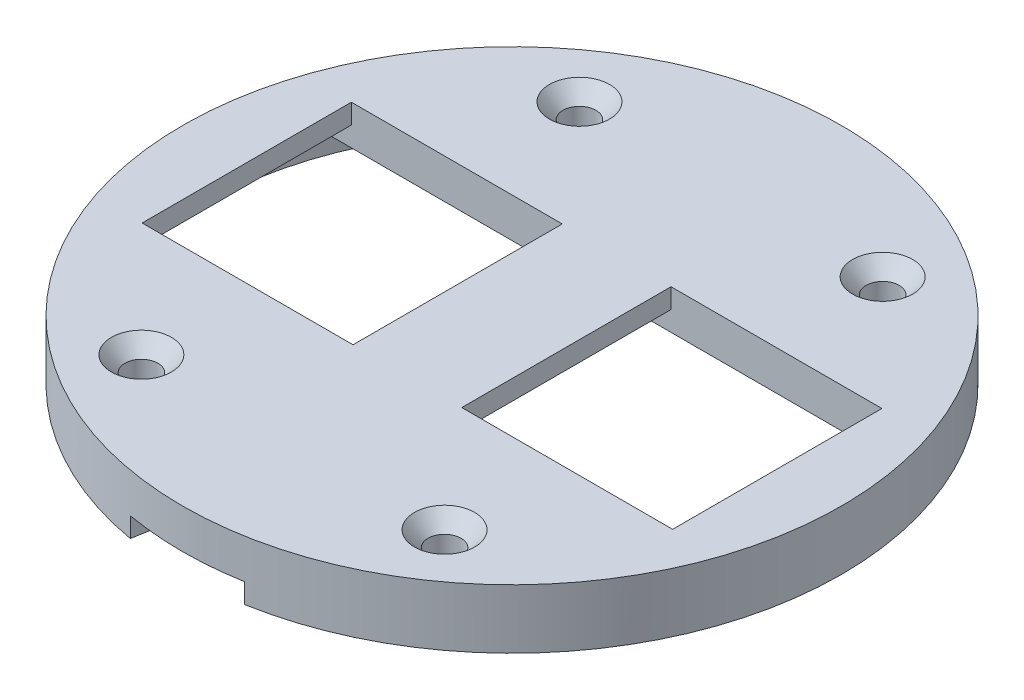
ISO-10303-21;
HEADER;
FILE_DESCRIPTION(('STEP AP214'),'2;1');
FILE_NAME('part.step','',(''),(''),'','','');
FILE_SCHEMA(('AUTOMOTIVE_DESIGN { 1 0 10303 214 1 1 1 1 }'));
ENDSEC;
DATA;
#1=APPLICATION_CONTEXT('core data for automotive mechanical design processes');
#2=APPLICATION_PROTOCOL_DEFINITION('international standard','automotive_design',2000,#1);
#3=PRODUCT_CONTEXT('',#1,'mechanical');
#4=PRODUCT('Part','Part','',(#3));
#5=PRODUCT_RELATED_PRODUCT_CATEGORY('part','',(#4));
#6=PRODUCT_DEFINITION_FORMATION('','',#4);
#7=PRODUCT_DEFINITION_CONTEXT('part definition',#1,'design');
#8=PRODUCT_DEFINITION('design','',#6,#7);
#9=PRODUCT_DEFINITION_SHAPE('','',#8);
#10=(LENGTH_UNIT() NAMED_UNIT(*) SI_UNIT(.MILLI.,.METRE.));
#11=(NAMED_UNIT(*) PLANE_ANGLE_UNIT() SI_UNIT($,.RADIAN.));
#12=(NAMED_UNIT(*) SI_UNIT($,.STERADIAN.) SOLID_ANGLE_UNIT());
#13=UNCERTAINTY_MEASURE_WITH_UNIT(LENGTH_MEASURE(1.E-05),#10,'distance_accuracy_value','');
#14=(GEOMETRIC_REPRESENTATION_CONTEXT(3) GLOBAL_UNCERTAINTY_ASSIGNED_CONTEXT((#13)) GLOBAL_UNIT_ASSIGNED_CONTEXT((#10,
#11,#12)) REPRESENTATION_CONTEXT('',''));
#15=CARTESIAN_POINT('',(0.,0.,0.));
#16=DIRECTION('',(0.,0.,1.));
#17=DIRECTION('',(1.,0.,0.));
#18=AXIS2_PLACEMENT_3D('',#15,#16,#17);
#19=CARTESIAN_POINT('',(0.,0.,0.));
#20=DIRECTION('',(0.,1.,0.));
#21=DIRECTION('',(0.,0.,1.));
#22=AXIS2_PLACEMENT_3D('',#19,#20,#21);
#23=PLANE('',#22);
#24=DIRECTION('',(0.,0.,-1.));
#25=VECTOR('',#24,1.);
#26=CARTESIAN_POINT('',(44.25,0.,0.));
#27=LINE('',#26,#25);
#28=CARTESIAN_POINT('',(44.25,0.,15.8410069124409));
#29=VERTEX_POINT('',#28);
#30=CARTESIAN_POINT('',(44.25,0.,-15.8410069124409));
#31=VERTEX_POINT('',#30);
#32=EDGE_CURVE('E423',#29,#31,#27,.T.);
#33=ORIENTED_EDGE('',*,*,#32,.F.);
#34=CARTESIAN_POINT('',(0.,0.,0.));
#35=DIRECTION('',(0.,-1.,0.));
#36=DIRECTION('',(0.,0.,-1.));
#37=AXIS2_PLACEMENT_3D('',#34,#35,#36);
#38=CIRCLE('',#37,47.);
#39=CARTESIAN_POINT('',(44.2378161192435,0.,15.875));
#40=VERTEX_POINT('',#39);
#41=EDGE_CURVE('E420',#29,#40,#38,.T.);
#42=ORIENTED_EDGE('',*,*,#41,.T.);
#43=DIRECTION('',(1.,0.,0.));
#44=VECTOR('',#43,1.);
#45=CARTESIAN_POINT('',(0.,0.,15.875));
#46=LINE('',#45,#44);
#47=CARTESIAN_POINT('',(40.25,0.,15.875));
#48=VERTEX_POINT('',#47);
#49=EDGE_CURVE('E580',#48,#40,#46,.T.);
#50=ORIENTED_EDGE('',*,*,#49,.F.);
#51=DIRECTION('',(0.,0.,1.));
#52=VECTOR('',#51,1.);
#53=CARTESIAN_POINT('',(40.25,0.,-15.875));
#54=LINE('',#53,#52);
#55=CARTESIAN_POINT('',(40.25,0.,-15.875));
#56=VERTEX_POINT('',#55);
#57=EDGE_CURVE('E635',#56,#48,#54,.T.);
#58=ORIENTED_EDGE('',*,*,#57,.F.);
#59=DIRECTION('',(1.,0.,0.));
#60=VECTOR('',#59,1.);
#61=CARTESIAN_POINT('',(0.,0.,-15.875));
#62=LINE('',#61,#60);
#63=CARTESIAN_POINT('',(44.2378161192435,0.,-15.875));
#64=VERTEX_POINT('',#63);
#65=EDGE_CURVE('E592',#56,#64,#62,.T.);
#66=ORIENTED_EDGE('',*,*,#65,.T.);
#67=EDGE_CURVE('E725',#64,#31,#38,.T.);
#68=ORIENTED_EDGE('',*,*,#67,.T.);
#69=EDGE_LOOP('',(#33,#42,#50,#58,#66,#68));
#70=FACE_BOUND('',#69,.T.);
#71=ADVANCED_FACE('F34',(#70),#23,.F.);
#72=CARTESIAN_POINT('',(0.,-6.,0.));
#73=DIRECTION('',(0.,1.,0.));
#74=DIRECTION('',(0.,0.,1.));
#75=AXIS2_PLACEMENT_3D('',#72,#73,#74);
#76=CYLINDRICAL_SURFACE('',#75,47.);
#77=CARTESIAN_POINT('',(0.,-3.,0.));
#78=DIRECTION('',(0.,-1.,0.));
#79=DIRECTION('',(0.,0.,-1.));
#80=AXIS2_PLACEMENT_3D('',#77,#78,#79);
#81=CIRCLE('',#80,47.);
#82=CARTESIAN_POINT('',(44.25,-3.,-15.8410069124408));
#83=VERTEX_POINT('',#82);
#84=CARTESIAN_POINT('',(44.25,-3.,15.8410069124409));
#85=VERTEX_POINT('',#84);
#86=EDGE_CURVE('E417',#83,#85,#81,.T.);
#87=ORIENTED_EDGE('',*,*,#86,.F.);
#88=DIRECTION('',(0.,1.,0.));
#89=VECTOR('',#88,1.);
#90=CARTESIAN_POINT('',(44.25,-132.088874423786,-15.8410069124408));
#91=LINE('',#90,#89);
#92=EDGE_CURVE('E424',#83,#31,#91,.T.);
#93=ORIENTED_EDGE('',*,*,#92,.T.);
#94=ORIENTED_EDGE('',*,*,#67,.F.);
#95=DIRECTION('',(0.,1.,0.));
#96=VECTOR('',#95,1.);
#97=CARTESIAN_POINT('',(44.2378161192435,-132.088874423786,-15.875));
#98=LINE('',#97,#96);
#99=CARTESIAN_POINT('',(44.2378161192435,-3.,-15.875));
#100=VERTEX_POINT('',#99);
#101=EDGE_CURVE('E597',#100,#64,#98,.T.);
#102=ORIENTED_EDGE('',*,*,#101,.F.);
#103=CARTESIAN_POINT('',(0.,-3.,0.));
#104=DIRECTION('',(0.,-1.,0.));
#105=DIRECTION('',(0.,0.,-1.));
#106=AXIS2_PLACEMENT_3D('',#103,#104,#105);
#107=CIRCLE('',#106,47.);
#108=CARTESIAN_POINT('',(8.16146435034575,-3.,-46.2859643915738));
#109=VERTEX_POINT('',#108);
#110=EDGE_CURVE('E448',#109,#100,#107,.T.);
#111=ORIENTED_EDGE('',*,*,#110,.F.);
#112=DIRECTION('',(0.,-1.,0.));
#113=VECTOR('',#112,1.);
#114=CARTESIAN_POINT('',(8.16146435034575,-3.,-46.2859643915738));
#115=LINE('',#114,#113);
#116=CARTESIAN_POINT('',(8.16146435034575,-6.,-46.2859643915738));
#117=VERTEX_POINT('',#116);
#118=EDGE_CURVE('E686',#109,#117,#115,.T.);
#119=ORIENTED_EDGE('',*,*,#118,.T.);
#120=CARTESIAN_POINT('',(0.,-6.,0.));
#121=DIRECTION('',(0.,-1.,0.));
#122=DIRECTION('',(0.,0.,-1.));
#123=AXIS2_PLACEMENT_3D('',#120,#121,#122);
#124=CIRCLE('',#123,47.);
#125=CARTESIAN_POINT('',(8.16146435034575,-6.,46.2859643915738));
#126=VERTEX_POINT('',#125);
#127=EDGE_CURVE('E724',#117,#126,#124,.T.);
#128=ORIENTED_EDGE('',*,*,#127,.T.);
#129=DIRECTION('',(0.,-1.,0.));
#130=VECTOR('',#129,1.);
#131=CARTESIAN_POINT('',(8.16146435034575,-3.,46.2859643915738));
#132=LINE('',#131,#130);
#133=CARTESIAN_POINT('',(8.16146435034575,-3.,46.2859643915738));
#134=VERTEX_POINT('',#133);
#135=EDGE_CURVE('E705',#134,#126,#132,.T.);
#136=ORIENTED_EDGE('',*,*,#135,.F.);
#137=CARTESIAN_POINT('',(0.,-3.,0.));
#138=DIRECTION('',(0.,-1.,0.));
#139=DIRECTION('',(0.,0.,-1.));
#140=AXIS2_PLACEMENT_3D('',#137,#138,#139);
#141=CIRCLE('',#140,47.);
#142=CARTESIAN_POINT('',(44.2378161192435,-3.,15.875));
#143=VERTEX_POINT('',#142);
#144=EDGE_CURVE('E462',#143,#134,#141,.T.);
#145=ORIENTED_EDGE('',*,*,#144,.F.);
#146=DIRECTION('',(0.,1.,0.));
#147=VECTOR('',#146,1.);
#148=CARTESIAN_POINT('',(44.2378161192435,-132.088874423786,15.875));
#149=LINE('',#148,#147);
#150=EDGE_CURVE('E608',#143,#40,#149,.T.);
#151=ORIENTED_EDGE('',*,*,#150,.T.);
#152=ORIENTED_EDGE('',*,*,#41,.F.);
#153=DIRECTION('',(0.,1.,0.));
#154=VECTOR('',#153,1.);
#155=CARTESIAN_POINT('',(44.25,-132.088874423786,15.8410069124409));
#156=LINE('',#155,#154);
#157=EDGE_CURVE('E413',#85,#29,#156,.T.);
#158=ORIENTED_EDGE('',*,*,#157,.F.);
#159=EDGE_LOOP('',(#87,#93,#94,#102,#111,#119,#128,#136,#145,#151,#152,#158));
#160=FACE_BOUND('',#159,.T.);
#161=ADVANCED_FACE('F415',(#160),#76,.F.);
#162=CARTESIAN_POINT('',(-44.2378161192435,0.,15.875));
#163=VERTEX_POINT('',#162);
#164=CARTESIAN_POINT('',(-44.25,0.,15.8410069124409));
#165=VERTEX_POINT('',#164);
#166=EDGE_CURVE('E728',#163,#165,#38,.T.);
#167=ORIENTED_EDGE('',*,*,#166,.T.);
#168=DIRECTION('',(0.,0.,-1.));
#169=VECTOR('',#168,1.);
#170=CARTESIAN_POINT('',(-44.25,0.,0.));
#171=LINE('',#170,#169);
#172=CARTESIAN_POINT('',(-44.25,0.,-15.8410069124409));
#173=VERTEX_POINT('',#172);
#174=EDGE_CURVE('E442',#165,#173,#171,.T.);
#175=ORIENTED_EDGE('',*,*,#174,.T.);
#176=CARTESIAN_POINT('',(-44.2378161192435,0.,-15.875));
#177=VERTEX_POINT('',#176);
#178=EDGE_CURVE('E712',#173,#177,#38,.T.);
#179=ORIENTED_EDGE('',*,*,#178,.T.);
#180=DIRECTION('',(-1.,0.,0.));
#181=VECTOR('',#180,1.);
#182=CARTESIAN_POINT('',(0.,0.,-15.875));
#183=LINE('',#182,#181);
#184=CARTESIAN_POINT('',(-40.25,0.,-15.875));
#185=VERTEX_POINT('',#184);
#186=EDGE_CURVE('E589',#185,#177,#183,.T.);
#187=ORIENTED_EDGE('',*,*,#186,.F.);
#188=DIRECTION('',(0.,0.,-1.));
#189=VECTOR('',#188,1.);
#190=CARTESIAN_POINT('',(-40.25,0.,-15.875));
#191=LINE('',#190,#189);
#192=CARTESIAN_POINT('',(-40.25,0.,15.875));
#193=VERTEX_POINT('',#192);
#194=EDGE_CURVE('E530',#193,#185,#191,.T.);
#195=ORIENTED_EDGE('',*,*,#194,.F.);
#196=DIRECTION('',(-1.,0.,0.));
#197=VECTOR('',#196,1.);
#198=CARTESIAN_POINT('',(0.,0.,15.875));
#199=LINE('',#198,#197);
#200=EDGE_CURVE('E583',#193,#163,#199,.T.);
#201=ORIENTED_EDGE('',*,*,#200,.T.);
#202=EDGE_LOOP('',(#167,#175,#179,#187,#195,#201));
#203=FACE_BOUND('',#202,.T.);
#204=ADVANCED_FACE('F918',(#203),#23,.F.);
#205=CARTESIAN_POINT('',(-4.25,0.,-15.875));
#206=VERTEX_POINT('',#205);
#207=CARTESIAN_POINT('',(-8.25000000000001,0.,-15.875));
#208=VERTEX_POINT('',#207);
#209=EDGE_CURVE('E590',#206,#208,#183,.T.);
#210=ORIENTED_EDGE('',*,*,#209,.F.);
#211=DIRECTION('',(0.,0.,-1.));
#212=VECTOR('',#211,1.);
#213=CARTESIAN_POINT('',(-4.25000000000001,0.,0.));
#214=LINE('',#213,#212);
#215=CARTESIAN_POINT('',(-4.25000000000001,0.,15.875));
#216=VERTEX_POINT('',#215);
#217=EDGE_CURVE('E586',#216,#206,#214,.T.);
#218=ORIENTED_EDGE('',*,*,#217,.F.);
#219=CARTESIAN_POINT('',(-8.25000000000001,0.,15.875));
#220=VERTEX_POINT('',#219);
#221=EDGE_CURVE('E584',#216,#220,#199,.T.);
#222=ORIENTED_EDGE('',*,*,#221,.T.);
#223=DIRECTION('',(0.,0.,1.));
#224=VECTOR('',#223,1.);
#225=CARTESIAN_POINT('',(-8.25000000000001,0.,15.875));
#226=LINE('',#225,#224);
#227=EDGE_CURVE('E618',#208,#220,#226,.T.);
#228=ORIENTED_EDGE('',*,*,#227,.F.);
#229=EDGE_LOOP('',(#210,#218,#222,#228));
#230=FACE_BOUND('',#229,.T.);
#231=ADVANCED_FACE('F931',(#230),#23,.F.);
#232=CARTESIAN_POINT('',(0.,-6.,0.));
#233=DIRECTION('',(0.,-1.,0.));
#234=DIRECTION('',(0.,0.,-1.));
#235=AXIS2_PLACEMENT_3D('',#232,#233,#234);
#236=PLANE('',#235);
#237=DIRECTION('',(-0.17364817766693,0.,0.984807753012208));
#238=VECTOR('',#237,1.);
#239=CARTESIAN_POINT('',(8.68240888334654,-6.,-49.2403876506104));
#240=LINE('',#239,#238);
#241=CARTESIAN_POINT('',(8.68240888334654,-6.,-49.2403876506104));
#242=VERTEX_POINT('',#241);
#243=EDGE_CURVE('E678',#242,#117,#240,.T.);
#244=ORIENTED_EDGE('',*,*,#243,.F.);
#245=CARTESIAN_POINT('',(0.,-6.,0.));
#246=DIRECTION('',(0.,-1.,0.));
#247=DIRECTION('',(0.,0.,-1.));
#248=AXIS2_PLACEMENT_3D('',#245,#246,#247);
#249=CIRCLE('',#248,50.);
#250=CARTESIAN_POINT('',(8.68240888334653,-6.,49.2403876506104));
#251=VERTEX_POINT('',#250);
#252=EDGE_CURVE('E723',#242,#251,#249,.T.);
#253=ORIENTED_EDGE('',*,*,#252,.T.);
#254=DIRECTION('',(0.17364817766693,0.,0.984807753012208));
#255=VECTOR('',#254,1.);
#256=CARTESIAN_POINT('',(8.68240888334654,-6.,49.2403876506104));
#257=LINE('',#256,#255);
#258=EDGE_CURVE('E689',#126,#251,#257,.T.);
#259=ORIENTED_EDGE('',*,*,#258,.F.);
#260=ORIENTED_EDGE('',*,*,#127,.F.);
#261=EDGE_LOOP('',(#244,#253,#259,#260));
#262=FACE_BOUND('',#261,.T.);
#263=ADVANCED_FACE('F942',(#262),#236,.T.);
#264=CARTESIAN_POINT('',(0.,3.,0.));
#265=DIRECTION('',(0.,-1.,0.));
#266=DIRECTION('',(0.,0.,-1.));
#267=AXIS2_PLACEMENT_3D('',#264,#265,#266);
#268=CYLINDRICAL_SURFACE('',#267,50.);
#269=ORIENTED_EDGE('',*,*,#252,.F.);
#270=DIRECTION('',(0.,-1.,0.));
#271=VECTOR('',#270,1.);
#272=CARTESIAN_POINT('',(8.68240888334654,-3.,-49.2403876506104));
#273=LINE('',#272,#271);
#274=CARTESIAN_POINT('',(8.68240888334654,-3.,-49.2403876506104));
#275=VERTEX_POINT('',#274);
#276=EDGE_CURVE('E690',#275,#242,#273,.T.);
#277=ORIENTED_EDGE('',*,*,#276,.F.);
#278=CARTESIAN_POINT('',(0.,-3.,0.));
#279=DIRECTION('',(0.,-1.,0.));
#280=DIRECTION('',(0.,0.,1.));
#281=AXIS2_PLACEMENT_3D('',#278,#279,#280);
#282=CIRCLE('',#281,50.);
#283=CARTESIAN_POINT('',(-8.68240888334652,-3.,-49.2403876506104));
#284=VERTEX_POINT('',#283);
#285=EDGE_CURVE('E677',#284,#275,#282,.T.);
#286=ORIENTED_EDGE('',*,*,#285,.F.);
#287=DIRECTION('',(0.,-1.,0.));
#288=VECTOR('',#287,1.);
#289=CARTESIAN_POINT('',(-8.68240888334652,-3.,-49.2403876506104));
#290=LINE('',#289,#288);
#291=CARTESIAN_POINT('',(-8.68240888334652,-6.,-49.2403876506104));
#292=VERTEX_POINT('',#291);
#293=EDGE_CURVE('E692',#284,#292,#290,.T.);
#294=ORIENTED_EDGE('',*,*,#293,.T.);
#295=CARTESIAN_POINT('',(-8.68240888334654,-6.,49.2403876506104));
#296=VERTEX_POINT('',#295);
#297=EDGE_CURVE('E729',#296,#292,#249,.T.);
#298=ORIENTED_EDGE('',*,*,#297,.F.);
#299=DIRECTION('',(0.,-1.,0.));
#300=VECTOR('',#299,1.);
#301=CARTESIAN_POINT('',(-8.68240888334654,-3.,49.2403876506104));
#302=LINE('',#301,#300);
#303=CARTESIAN_POINT('',(-8.68240888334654,-3.,49.2403876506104));
#304=VERTEX_POINT('',#303);
#305=EDGE_CURVE('E713',#304,#296,#302,.T.);
#306=ORIENTED_EDGE('',*,*,#305,.F.);
#307=CARTESIAN_POINT('',(0.,-3.,0.));
#308=DIRECTION('',(0.,-1.,0.));
#309=DIRECTION('',(0.,0.,-1.));
#310=AXIS2_PLACEMENT_3D('',#307,#308,#309);
#311=CIRCLE('',#310,50.);
#312=CARTESIAN_POINT('',(8.68240888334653,-3.,49.2403876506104));
#313=VERTEX_POINT('',#312);
#314=EDGE_CURVE('E699',#313,#304,#311,.T.);
#315=ORIENTED_EDGE('',*,*,#314,.F.);
#316=DIRECTION('',(0.,-1.,0.));
#317=VECTOR('',#316,1.);
#318=CARTESIAN_POINT('',(8.68240888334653,-3.,49.2403876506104));
#319=LINE('',#318,#317);
#320=EDGE_CURVE('E715',#313,#251,#319,.T.);
#321=ORIENTED_EDGE('',*,*,#320,.T.);
#322=EDGE_LOOP('',(#269,#277,#286,#294,#298,#306,#315,#321));
#323=FACE_BOUND('',#322,.T.);
#324=CARTESIAN_POINT('',(0.,3.,0.));
#325=DIRECTION('',(0.,1.,0.));
#326=DIRECTION('',(0.,0.,1.));
#327=AXIS2_PLACEMENT_3D('',#324,#325,#326);
#328=CIRCLE('',#327,50.);
#329=CARTESIAN_POINT('',(0.,3.,50.));
#330=VERTEX_POINT('',#329);
#331=EDGE_CURVE('E732',#330,#330,#328,.T.);
#332=ORIENTED_EDGE('',*,*,#331,.F.);
#333=EDGE_LOOP('',(#332));
#334=FACE_BOUND('',#333,.T.);
#335=ADVANCED_FACE('F939',(#323,#334),#268,.T.);
#336=CARTESIAN_POINT('',(0.,3.,0.));
#337=DIRECTION('',(0.,1.,0.));
#338=DIRECTION('',(0.,0.,1.));
#339=AXIS2_PLACEMENT_3D('',#336,#337,#338);
#340=PLANE('',#339);
#341=CARTESIAN_POINT('',(-23.,3.,-33.2340187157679));
#342=DIRECTION('',(0.,1.,0.));
#343=DIRECTION('',(0.,0.,1.));
#344=AXIS2_PLACEMENT_3D('',#341,#342,#343);
#345=CIRCLE('',#344,4.5593);
#346=CARTESIAN_POINT('',(-23.,3.,-28.6747187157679));
#347=VERTEX_POINT('',#346);
#348=EDGE_CURVE('E1181',#347,#347,#345,.T.);
#349=ORIENTED_EDGE('',*,*,#348,.F.);
#350=EDGE_LOOP('',(#349));
#351=FACE_BOUND('',#350,.T.);
#352=CARTESIAN_POINT('',(23.,3.,-33.2340187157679));
#353=DIRECTION('',(0.,1.,0.));
#354=DIRECTION('',(0.,0.,1.));
#355=AXIS2_PLACEMENT_3D('',#352,#353,#354);
#356=CIRCLE('',#355,4.5593);
#357=CARTESIAN_POINT('',(23.,3.,-28.6747187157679));
#358=VERTEX_POINT('',#357);
#359=EDGE_CURVE('E887',#358,#358,#356,.T.);
#360=ORIENTED_EDGE('',*,*,#359,.F.);
#361=EDGE_LOOP('',(#360));
#362=FACE_BOUND('',#361,.T.);
#363=CARTESIAN_POINT('',(23.,3.,33.2340187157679));
#364=DIRECTION('',(0.,1.,0.));
#365=DIRECTION('',(0.,0.,1.));
#366=AXIS2_PLACEMENT_3D('',#363,#364,#365);
#367=CIRCLE('',#366,4.5593);
#368=CARTESIAN_POINT('',(23.,3.,37.7933187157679));
#369=VERTEX_POINT('',#368);
#370=EDGE_CURVE('E877',#369,#369,#367,.T.);
#371=ORIENTED_EDGE('',*,*,#370,.F.);
#372=EDGE_LOOP('',(#371));
#373=FACE_BOUND('',#372,.T.);
#374=CARTESIAN_POINT('',(-23.,3.,33.2340187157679));
#375=DIRECTION('',(0.,1.,0.));
#376=DIRECTION('',(0.,0.,1.));
#377=AXIS2_PLACEMENT_3D('',#374,#375,#376);
#378=CIRCLE('',#377,4.5593);
#379=CARTESIAN_POINT('',(-23.,3.,37.7933187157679));
#380=VERTEX_POINT('',#379);
#381=EDGE_CURVE('E876',#380,#380,#378,.T.);
#382=ORIENTED_EDGE('',*,*,#381,.F.);
#383=EDGE_LOOP('',(#382));
#384=FACE_BOUND('',#383,.T.);
#385=DIRECTION('',(-1.,0.,0.));
#386=VECTOR('',#385,1.);
#387=CARTESIAN_POINT('',(-40.25,3.,15.875));
#388=LINE('',#387,#386);
#389=CARTESIAN_POINT('',(-8.25000000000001,3.,15.875));
#390=VERTEX_POINT('',#389);
#391=CARTESIAN_POINT('',(-40.25,3.,15.875));
#392=VERTEX_POINT('',#391);
#393=EDGE_CURVE('E614',#390,#392,#388,.T.);
#394=ORIENTED_EDGE('',*,*,#393,.T.);
#395=DIRECTION('',(0.,0.,-1.));
#396=VECTOR('',#395,1.);
#397=CARTESIAN_POINT('',(-40.25,3.,-15.875));
#398=LINE('',#397,#396);
#399=CARTESIAN_POINT('',(-40.25,3.,-15.875));
#400=VERTEX_POINT('',#399);
#401=EDGE_CURVE('E617',#392,#400,#398,.T.);
#402=ORIENTED_EDGE('',*,*,#401,.T.);
#403=DIRECTION('',(1.,0.,0.));
#404=VECTOR('',#403,1.);
#405=CARTESIAN_POINT('',(-8.25000000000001,3.,-15.875));
#406=LINE('',#405,#404);
#407=CARTESIAN_POINT('',(-8.25000000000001,3.,-15.875));
#408=VERTEX_POINT('',#407);
#409=EDGE_CURVE('E621',#400,#408,#406,.T.);
#410=ORIENTED_EDGE('',*,*,#409,.T.);
#411=DIRECTION('',(0.,0.,1.));
#412=VECTOR('',#411,1.);
#413=CARTESIAN_POINT('',(-8.25000000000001,3.,15.875));
#414=LINE('',#413,#412);
#415=EDGE_CURVE('E624',#408,#390,#414,.T.);
#416=ORIENTED_EDGE('',*,*,#415,.T.);
#417=EDGE_LOOP('',(#394,#402,#410,#416));
#418=FACE_BOUND('',#417,.T.);
#419=DIRECTION('',(1.,0.,0.));
#420=VECTOR('',#419,1.);
#421=CARTESIAN_POINT('',(8.25000000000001,3.,-15.875));
#422=LINE('',#421,#420);
#423=CARTESIAN_POINT('',(8.25000000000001,3.,-15.875));
#424=VERTEX_POINT('',#423);
#425=CARTESIAN_POINT('',(40.25,3.,-15.875));
#426=VERTEX_POINT('',#425);
#427=EDGE_CURVE('E644',#424,#426,#422,.T.);
#428=ORIENTED_EDGE('',*,*,#427,.T.);
#429=DIRECTION('',(0.,0.,1.));
#430=VECTOR('',#429,1.);
#431=CARTESIAN_POINT('',(40.25,3.,-15.875));
#432=LINE('',#431,#430);
#433=CARTESIAN_POINT('',(40.25,3.,15.875));
#434=VERTEX_POINT('',#433);
#435=EDGE_CURVE('E647',#426,#434,#432,.T.);
#436=ORIENTED_EDGE('',*,*,#435,.T.);
#437=DIRECTION('',(-1.,0.,0.));
#438=VECTOR('',#437,1.);
#439=CARTESIAN_POINT('',(40.25,3.,15.875));
#440=LINE('',#439,#438);
#441=CARTESIAN_POINT('',(8.25000000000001,3.,15.875));
#442=VERTEX_POINT('',#441);
#443=EDGE_CURVE('E651',#434,#442,#440,.T.);
#444=ORIENTED_EDGE('',*,*,#443,.T.);
#445=DIRECTION('',(0.,0.,-1.));
#446=VECTOR('',#445,1.);
#447=CARTESIAN_POINT('',(8.25000000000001,3.,15.875));
#448=LINE('',#447,#446);
#449=EDGE_CURVE('E654',#442,#424,#448,.T.);
#450=ORIENTED_EDGE('',*,*,#449,.T.);
#451=EDGE_LOOP('',(#428,#436,#444,#450));
#452=FACE_BOUND('',#451,.T.);
#453=ORIENTED_EDGE('',*,*,#331,.T.);
#454=EDGE_LOOP('',(#453));
#455=FACE_BOUND('',#454,.T.);
#456=ADVANCED_FACE('F929',(#351,#362,#373,#384,#418,#452,#455),#340,.T.);
#457=DIRECTION('',(0.,0.,-1.));
#458=VECTOR('',#457,1.);
#459=CARTESIAN_POINT('',(4.25000000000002,0.,0.));
#460=LINE('',#459,#458);
#461=CARTESIAN_POINT('',(4.25000000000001,0.,15.875));
#462=VERTEX_POINT('',#461);
#463=CARTESIAN_POINT('',(4.25000000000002,0.,-15.875));
#464=VERTEX_POINT('',#463);
#465=EDGE_CURVE('E577',#462,#464,#460,.T.);
#466=ORIENTED_EDGE('',*,*,#465,.T.);
#467=CARTESIAN_POINT('',(8.25000000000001,0.,-15.875));
#468=VERTEX_POINT('',#467);
#469=EDGE_CURVE('E593',#464,#468,#62,.T.);
#470=ORIENTED_EDGE('',*,*,#469,.T.);
#471=DIRECTION('',(0.,0.,-1.));
#472=VECTOR('',#471,1.);
#473=CARTESIAN_POINT('',(8.25000000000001,0.,15.875));
#474=LINE('',#473,#472);
#475=CARTESIAN_POINT('',(8.25000000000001,0.,15.875));
#476=VERTEX_POINT('',#475);
#477=EDGE_CURVE('E648',#476,#468,#474,.T.);
#478=ORIENTED_EDGE('',*,*,#477,.F.);
#479=EDGE_CURVE('E581',#462,#476,#46,.T.);
#480=ORIENTED_EDGE('',*,*,#479,.F.);
#481=EDGE_LOOP('',(#466,#470,#478,#480));
#482=FACE_BOUND('',#481,.T.);
#483=ADVANCED_FACE('F914',(#482),#23,.F.);
#484=CARTESIAN_POINT('',(-23.,0.,-33.2340187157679));
#485=DIRECTION('',(0.,1.,0.));
#486=DIRECTION('',(0.,0.,1.));
#487=AXIS2_PLACEMENT_3D('',#484,#485,#486);
#488=CYLINDRICAL_SURFACE('',#487,2.5);
#489=CARTESIAN_POINT('',(-23.,0.631046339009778,-33.2340187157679));
#490=DIRECTION('',(0.,1.,0.));
#491=DIRECTION('',(0.,0.,1.));
#492=AXIS2_PLACEMENT_3D('',#489,#490,#491);
#493=CIRCLE('',#492,2.5);
#494=CARTESIAN_POINT('',(-23.,0.631046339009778,-30.7340187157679));
#495=VERTEX_POINT('',#494);
#496=EDGE_CURVE('E1179',#495,#495,#493,.T.);
#497=ORIENTED_EDGE('',*,*,#496,.T.);
#498=EDGE_LOOP('',(#497));
#499=FACE_BOUND('',#498,.T.);
#500=CARTESIAN_POINT('',(-23.,-3.,-33.2340187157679));
#501=DIRECTION('',(0.,-1.,0.));
#502=DIRECTION('',(0.,0.,-1.));
#503=AXIS2_PLACEMENT_3D('',#500,#501,#502);
#504=CIRCLE('',#503,2.5);
#505=CARTESIAN_POINT('',(-23.,-3.,-35.7340187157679));
#506=VERTEX_POINT('',#505);
#507=EDGE_CURVE('E524',#506,#506,#504,.F.);
#508=ORIENTED_EDGE('',*,*,#507,.F.);
#509=EDGE_LOOP('',(#508));
#510=FACE_BOUND('',#509,.T.);
#511=ADVANCED_FACE('F928',(#499,#510),#488,.F.);
#512=CARTESIAN_POINT('',(23.,0.,-33.2340187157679));
#513=DIRECTION('',(0.,1.,0.));
#514=DIRECTION('',(0.,0.,1.));
#515=AXIS2_PLACEMENT_3D('',#512,#513,#514);
#516=CYLINDRICAL_SURFACE('',#515,2.5);
#517=CARTESIAN_POINT('',(23.,0.631046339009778,-33.2340187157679));
#518=DIRECTION('',(0.,1.,0.));
#519=DIRECTION('',(0.,0.,1.));
#520=AXIS2_PLACEMENT_3D('',#517,#518,#519);
#521=CIRCLE('',#520,2.5);
#522=CARTESIAN_POINT('',(23.,0.631046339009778,-30.7340187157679));
#523=VERTEX_POINT('',#522);
#524=EDGE_CURVE('E38',#523,#523,#521,.T.);
#525=ORIENTED_EDGE('',*,*,#524,.T.);
#526=EDGE_LOOP('',(#525));
#527=FACE_BOUND('',#526,.T.);
#528=CARTESIAN_POINT('',(23.,-3.,-33.2340187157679));
#529=DIRECTION('',(0.,-1.,0.));
#530=DIRECTION('',(0.,0.,-1.));
#531=AXIS2_PLACEMENT_3D('',#528,#529,#530);
#532=CIRCLE('',#531,2.5);
#533=CARTESIAN_POINT('',(23.,-3.,-35.7340187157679));
#534=VERTEX_POINT('',#533);
#535=EDGE_CURVE('E520',#534,#534,#532,.F.);
#536=ORIENTED_EDGE('',*,*,#535,.F.);
#537=EDGE_LOOP('',(#536));
#538=FACE_BOUND('',#537,.T.);
#539=ADVANCED_FACE('F936',(#527,#538),#516,.F.);
#540=CARTESIAN_POINT('',(23.,0.,33.2340187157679));
#541=DIRECTION('',(0.,1.,0.));
#542=DIRECTION('',(0.,0.,1.));
#543=AXIS2_PLACEMENT_3D('',#540,#541,#542);
#544=CYLINDRICAL_SURFACE('',#543,2.5);
#545=CARTESIAN_POINT('',(23.,0.631046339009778,33.2340187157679));
#546=DIRECTION('',(0.,1.,0.));
#547=DIRECTION('',(0.,0.,1.));
#548=AXIS2_PLACEMENT_3D('',#545,#546,#547);
#549=CIRCLE('',#548,2.5);
#550=CARTESIAN_POINT('',(23.,0.631046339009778,35.7340187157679));
#551=VERTEX_POINT('',#550);
#552=EDGE_CURVE('E874',#551,#551,#549,.T.);
#553=ORIENTED_EDGE('',*,*,#552,.T.);
#554=EDGE_LOOP('',(#553));
#555=FACE_BOUND('',#554,.T.);
#556=CARTESIAN_POINT('',(23.,-3.,33.2340187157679));
#557=DIRECTION('',(0.,-1.,0.));
#558=DIRECTION('',(0.,0.,-1.));
#559=AXIS2_PLACEMENT_3D('',#556,#557,#558);
#560=CIRCLE('',#559,2.5);
#561=CARTESIAN_POINT('',(23.,-3.,30.7340187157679));
#562=VERTEX_POINT('',#561);
#563=EDGE_CURVE('E527',#562,#562,#560,.F.);
#564=ORIENTED_EDGE('',*,*,#563,.F.);
#565=EDGE_LOOP('',(#564));
#566=FACE_BOUND('',#565,.T.);
#567=ADVANCED_FACE('F1152',(#555,#566),#544,.F.);
#568=CARTESIAN_POINT('',(-23.,0.,33.2340187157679));
#569=DIRECTION('',(0.,1.,0.));
#570=DIRECTION('',(0.,0.,1.));
#571=AXIS2_PLACEMENT_3D('',#568,#569,#570);
#572=CYLINDRICAL_SURFACE('',#571,2.5);
#573=CARTESIAN_POINT('',(-23.,0.631046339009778,33.2340187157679));
#574=DIRECTION('',(0.,1.,0.));
#575=DIRECTION('',(0.,0.,1.));
#576=AXIS2_PLACEMENT_3D('',#573,#574,#575);
#577=CIRCLE('',#576,2.5);
#578=CARTESIAN_POINT('',(-23.,0.631046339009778,35.7340187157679));
#579=VERTEX_POINT('',#578);
#580=EDGE_CURVE('E441',#579,#579,#577,.T.);
#581=ORIENTED_EDGE('',*,*,#580,.T.);
#582=EDGE_LOOP('',(#581));
#583=FACE_BOUND('',#582,.T.);
#584=CARTESIAN_POINT('',(-23.,-3.,33.2340187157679));
#585=DIRECTION('',(0.,-1.,0.));
#586=DIRECTION('',(0.,0.,-1.));
#587=AXIS2_PLACEMENT_3D('',#584,#585,#586);
#588=CIRCLE('',#587,2.5);
#589=CARTESIAN_POINT('',(-23.,-3.,30.7340187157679));
#590=VERTEX_POINT('',#589);
#591=EDGE_CURVE('E517',#590,#590,#588,.F.);
#592=ORIENTED_EDGE('',*,*,#591,.F.);
#593=EDGE_LOOP('',(#592));
#594=FACE_BOUND('',#593,.T.);
#595=ADVANCED_FACE('F893',(#583,#594),#572,.F.);
#596=DIRECTION('',(-0.17364817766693,0.,-0.984807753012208));
#597=VECTOR('',#596,1.);
#598=CARTESIAN_POINT('',(-8.68240888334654,-6.,-49.2403876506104));
#599=LINE('',#598,#597);
#600=CARTESIAN_POINT('',(-8.16146435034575,-6.,-46.2859643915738));
#601=VERTEX_POINT('',#600);
#602=EDGE_CURVE('E665',#601,#292,#599,.T.);
#603=ORIENTED_EDGE('',*,*,#602,.F.);
#604=CARTESIAN_POINT('',(-8.16146435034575,-6.,46.2859643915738));
#605=VERTEX_POINT('',#604);
#606=EDGE_CURVE('E720',#605,#601,#124,.T.);
#607=ORIENTED_EDGE('',*,*,#606,.F.);
#608=DIRECTION('',(0.17364817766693,0.,-0.984807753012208));
#609=VECTOR('',#608,1.);
#610=CARTESIAN_POINT('',(-8.68240888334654,-6.,49.2403876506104));
#611=LINE('',#610,#609);
#612=EDGE_CURVE('E700',#296,#605,#611,.T.);
#613=ORIENTED_EDGE('',*,*,#612,.F.);
#614=ORIENTED_EDGE('',*,*,#297,.T.);
#615=EDGE_LOOP('',(#603,#607,#613,#614));
#616=FACE_BOUND('',#615,.T.);
#617=ADVANCED_FACE('F950',(#616),#236,.T.);
#618=DIRECTION('',(0.,1.,0.));
#619=VECTOR('',#618,1.);
#620=CARTESIAN_POINT('',(-44.25,-132.088874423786,-15.8410069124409));
#621=LINE('',#620,#619);
#622=CARTESIAN_POINT('',(-44.25,-3.,-15.8410069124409));
#623=VERTEX_POINT('',#622);
#624=EDGE_CURVE('E435',#623,#173,#621,.T.);
#625=ORIENTED_EDGE('',*,*,#624,.F.);
#626=CARTESIAN_POINT('',(0.,-3.,0.));
#627=DIRECTION('',(0.,-1.,0.));
#628=DIRECTION('',(0.,0.,-1.));
#629=AXIS2_PLACEMENT_3D('',#626,#627,#628);
#630=CIRCLE('',#629,47.);
#631=CARTESIAN_POINT('',(-44.25,-3.,15.8410069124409));
#632=VERTEX_POINT('',#631);
#633=EDGE_CURVE('E443',#632,#623,#630,.T.);
#634=ORIENTED_EDGE('',*,*,#633,.F.);
#635=DIRECTION('',(0.,1.,0.));
#636=VECTOR('',#635,1.);
#637=CARTESIAN_POINT('',(-44.25,-132.088874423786,15.8410069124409));
#638=LINE('',#637,#636);
#639=EDGE_CURVE('E444',#632,#165,#638,.T.);
#640=ORIENTED_EDGE('',*,*,#639,.T.);
#641=ORIENTED_EDGE('',*,*,#166,.F.);
#642=DIRECTION('',(0.,1.,0.));
#643=VECTOR('',#642,1.);
#644=CARTESIAN_POINT('',(-44.2378161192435,-132.088874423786,15.875));
#645=LINE('',#644,#643);
#646=CARTESIAN_POINT('',(-44.2378161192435,-3.,15.875));
#647=VERTEX_POINT('',#646);
#648=EDGE_CURVE('E606',#647,#163,#645,.T.);
#649=ORIENTED_EDGE('',*,*,#648,.F.);
#650=CARTESIAN_POINT('',(-8.16146435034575,-3.,46.2859643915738));
#651=VERTEX_POINT('',#650);
#652=EDGE_CURVE('E461',#651,#647,#141,.T.);
#653=ORIENTED_EDGE('',*,*,#652,.F.);
#654=DIRECTION('',(0.,-1.,0.));
#655=VECTOR('',#654,1.);
#656=CARTESIAN_POINT('',(-8.16146435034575,-3.,46.2859643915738));
#657=LINE('',#656,#655);
#658=EDGE_CURVE('E709',#651,#605,#657,.T.);
#659=ORIENTED_EDGE('',*,*,#658,.T.);
#660=ORIENTED_EDGE('',*,*,#606,.T.);
#661=DIRECTION('',(0.,-1.,0.));
#662=VECTOR('',#661,1.);
#663=CARTESIAN_POINT('',(-8.16146435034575,-3.,-46.2859643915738));
#664=LINE('',#663,#662);
#665=CARTESIAN_POINT('',(-8.16146435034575,-3.,-46.2859643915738));
#666=VERTEX_POINT('',#665);
#667=EDGE_CURVE('E683',#666,#601,#664,.T.);
#668=ORIENTED_EDGE('',*,*,#667,.F.);
#669=CARTESIAN_POINT('',(-44.2378161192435,-3.,-15.875));
#670=VERTEX_POINT('',#669);
#671=EDGE_CURVE('E452',#670,#666,#107,.T.);
#672=ORIENTED_EDGE('',*,*,#671,.F.);
#673=DIRECTION('',(0.,1.,0.));
#674=VECTOR('',#673,1.);
#675=CARTESIAN_POINT('',(-44.2378161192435,-132.088874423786,-15.875));
#676=LINE('',#675,#674);
#677=EDGE_CURVE('E599',#670,#177,#676,.T.);
#678=ORIENTED_EDGE('',*,*,#677,.T.);
#679=ORIENTED_EDGE('',*,*,#178,.F.);
#680=EDGE_LOOP('',(#625,#634,#640,#641,#649,#653,#659,#660,#668,#672,#678,#679));
#681=FACE_BOUND('',#680,.T.);
#682=ADVANCED_FACE('F920',(#681),#76,.F.);
#683=CARTESIAN_POINT('',(-8.68240888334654,-3.,49.2403876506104));
#684=DIRECTION('',(-0.984807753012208,0.,-0.17364817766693));
#685=DIRECTION('',(-0.17364817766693,0.,0.984807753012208));
#686=AXIS2_PLACEMENT_3D('',#683,#684,#685);
#687=PLANE('',#686);
#688=ORIENTED_EDGE('',*,*,#612,.T.);
#689=ORIENTED_EDGE('',*,*,#658,.F.);
#690=DIRECTION('',(0.17364817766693,0.,-0.984807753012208));
#691=VECTOR('',#690,1.);
#692=CARTESIAN_POINT('',(-8.68240888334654,-3.,49.2403876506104));
#693=LINE('',#692,#691);
#694=EDGE_CURVE('E702',#304,#651,#693,.T.);
#695=ORIENTED_EDGE('',*,*,#694,.F.);
#696=ORIENTED_EDGE('',*,*,#305,.T.);
#697=EDGE_LOOP('',(#688,#689,#695,#696));
#698=FACE_BOUND('',#697,.T.);
#699=ADVANCED_FACE('F998',(#698),#687,.F.);
#700=CARTESIAN_POINT('',(8.68240888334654,-3.,49.2403876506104));
#701=DIRECTION('',(0.984807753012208,0.,-0.17364817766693));
#702=DIRECTION('',(-0.17364817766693,0.,-0.984807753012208));
#703=AXIS2_PLACEMENT_3D('',#700,#701,#702);
#704=PLANE('',#703);
#705=ORIENTED_EDGE('',*,*,#258,.T.);
#706=ORIENTED_EDGE('',*,*,#320,.F.);
#707=DIRECTION('',(0.17364817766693,0.,0.984807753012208));
#708=VECTOR('',#707,1.);
#709=CARTESIAN_POINT('',(8.68240888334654,-3.,49.2403876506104));
#710=LINE('',#709,#708);
#711=EDGE_CURVE('E696',#134,#313,#710,.T.);
#712=ORIENTED_EDGE('',*,*,#711,.F.);
#713=ORIENTED_EDGE('',*,*,#135,.T.);
#714=EDGE_LOOP('',(#705,#706,#712,#713));
#715=FACE_BOUND('',#714,.T.);
#716=ADVANCED_FACE('F1004',(#715),#704,.F.);
#717=CARTESIAN_POINT('',(0.,-3.,0.));
#718=DIRECTION('',(0.,-1.,0.));
#719=DIRECTION('',(0.,0.,-1.));
#720=AXIS2_PLACEMENT_3D('',#717,#718,#719);
#721=PLANE('',#720);
#722=ORIENTED_EDGE('',*,*,#694,.T.);
#723=ORIENTED_EDGE('',*,*,#652,.T.);
#724=DIRECTION('',(-1.,0.,0.));
#725=VECTOR('',#724,1.);
#726=CARTESIAN_POINT('',(0.,-3.,15.875));
#727=LINE('',#726,#725);
#728=CARTESIAN_POINT('',(-4.25000000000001,-3.,15.875));
#729=VERTEX_POINT('',#728);
#730=EDGE_CURVE('E458',#729,#647,#727,.T.);
#731=ORIENTED_EDGE('',*,*,#730,.F.);
#732=DIRECTION('',(0.,0.,-1.));
#733=VECTOR('',#732,1.);
#734=CARTESIAN_POINT('',(-4.25000000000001,-3.,0.));
#735=LINE('',#734,#733);
#736=CARTESIAN_POINT('',(-4.25,-3.,-15.875));
#737=VERTEX_POINT('',#736);
#738=EDGE_CURVE('E456',#729,#737,#735,.T.);
#739=ORIENTED_EDGE('',*,*,#738,.T.);
#740=DIRECTION('',(-1.,0.,0.));
#741=VECTOR('',#740,1.);
#742=CARTESIAN_POINT('',(0.,-3.,-15.875));
#743=LINE('',#742,#741);
#744=EDGE_CURVE('E454',#737,#670,#743,.T.);
#745=ORIENTED_EDGE('',*,*,#744,.T.);
#746=ORIENTED_EDGE('',*,*,#671,.T.);
#747=DIRECTION('',(-0.17364817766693,0.,-0.984807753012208));
#748=VECTOR('',#747,1.);
#749=CARTESIAN_POINT('',(-8.68240888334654,-3.,-49.2403876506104));
#750=LINE('',#749,#748);
#751=EDGE_CURVE('E674',#666,#284,#750,.T.);
#752=ORIENTED_EDGE('',*,*,#751,.T.);
#753=ORIENTED_EDGE('',*,*,#285,.T.);
#754=DIRECTION('',(-0.17364817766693,0.,0.984807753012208));
#755=VECTOR('',#754,1.);
#756=CARTESIAN_POINT('',(8.68240888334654,-3.,-49.2403876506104));
#757=LINE('',#756,#755);
#758=EDGE_CURVE('E680',#275,#109,#757,.T.);
#759=ORIENTED_EDGE('',*,*,#758,.T.);
#760=ORIENTED_EDGE('',*,*,#110,.T.);
#761=DIRECTION('',(1.,0.,0.));
#762=VECTOR('',#761,1.);
#763=CARTESIAN_POINT('',(0.,-3.,-15.875));
#764=LINE('',#763,#762);
#765=CARTESIAN_POINT('',(4.25000000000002,-3.,-15.875));
#766=VERTEX_POINT('',#765);
#767=EDGE_CURVE('E521',#766,#100,#764,.T.);
#768=ORIENTED_EDGE('',*,*,#767,.F.);
#769=DIRECTION('',(0.,0.,-1.));
#770=VECTOR('',#769,1.);
#771=CARTESIAN_POINT('',(4.25000000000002,-3.,0.));
#772=LINE('',#771,#770);
#773=CARTESIAN_POINT('',(4.25000000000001,-3.,15.875));
#774=VERTEX_POINT('',#773);
#775=EDGE_CURVE('E466',#774,#766,#772,.T.);
#776=ORIENTED_EDGE('',*,*,#775,.F.);
#777=DIRECTION('',(1.,0.,0.));
#778=VECTOR('',#777,1.);
#779=CARTESIAN_POINT('',(0.,-3.,15.875));
#780=LINE('',#779,#778);
#781=EDGE_CURVE('E464',#774,#143,#780,.T.);
#782=ORIENTED_EDGE('',*,*,#781,.T.);
#783=ORIENTED_EDGE('',*,*,#144,.T.);
#784=ORIENTED_EDGE('',*,*,#711,.T.);
#785=ORIENTED_EDGE('',*,*,#314,.T.);
#786=EDGE_LOOP('',(#722,#723,#731,#739,#745,#746,#752,#753,#759,#760,#768,#776,#782,#783,#784,#785));
#787=FACE_BOUND('',#786,.T.);
#788=ORIENTED_EDGE('',*,*,#507,.T.);
#789=EDGE_LOOP('',(#788));
#790=FACE_BOUND('',#789,.T.);
#791=ORIENTED_EDGE('',*,*,#591,.T.);
#792=EDGE_LOOP('',(#791));
#793=FACE_BOUND('',#792,.T.);
#794=DIRECTION('',(1.,0.,0.));
#795=VECTOR('',#794,1.);
#796=CARTESIAN_POINT('',(0.,-3.,18.875));
#797=LINE('',#796,#795);
#798=CARTESIAN_POINT('',(2.25000000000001,-3.,18.875));
#799=VERTEX_POINT('',#798);
#800=CARTESIAN_POINT('',(38.1311470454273,-3.,18.875));
#801=VERTEX_POINT('',#800);
#802=EDGE_CURVE('E510',#799,#801,#797,.T.);
#803=ORIENTED_EDGE('',*,*,#802,.F.);
#804=CARTESIAN_POINT('',(2.25000000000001,-3.,17.875));
#805=DIRECTION('',(0.,-1.,0.));
#806=DIRECTION('',(0.,0.,-1.));
#807=AXIS2_PLACEMENT_3D('',#804,#805,#806);
#808=CIRCLE('',#807,1.);
#809=CARTESIAN_POINT('',(1.25000000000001,-3.,17.875));
#810=VERTEX_POINT('',#809);
#811=EDGE_CURVE('E790',#799,#810,#808,.T.);
#812=ORIENTED_EDGE('',*,*,#811,.T.);
#813=DIRECTION('',(0.,0.,-1.));
#814=VECTOR('',#813,1.);
#815=CARTESIAN_POINT('',(1.25000000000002,-3.,0.));
#816=LINE('',#815,#814);
#817=CARTESIAN_POINT('',(1.25000000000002,-3.,-17.875));
#818=VERTEX_POINT('',#817);
#819=EDGE_CURVE('E507',#810,#818,#816,.T.);
#820=ORIENTED_EDGE('',*,*,#819,.T.);
#821=CARTESIAN_POINT('',(2.25000000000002,-3.,-17.875));
#822=DIRECTION('',(0.,-1.,0.));
#823=DIRECTION('',(0.,0.,-1.));
#824=AXIS2_PLACEMENT_3D('',#821,#822,#823);
#825=CIRCLE('',#824,1.);
#826=CARTESIAN_POINT('',(2.25000000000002,-3.,-18.875));
#827=VERTEX_POINT('',#826);
#828=EDGE_CURVE('E788',#818,#827,#825,.T.);
#829=ORIENTED_EDGE('',*,*,#828,.T.);
#830=DIRECTION('',(1.,0.,0.));
#831=VECTOR('',#830,1.);
#832=CARTESIAN_POINT('',(0.,-3.,-18.875));
#833=LINE('',#832,#831);
#834=CARTESIAN_POINT('',(38.1311470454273,-3.,-18.875));
#835=VERTEX_POINT('',#834);
#836=EDGE_CURVE('E504',#827,#835,#833,.T.);
#837=ORIENTED_EDGE('',*,*,#836,.T.);
#838=CARTESIAN_POINT('',(38.1311470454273,-3.,-19.875));
#839=DIRECTION('',(0.,-1.,0.));
#840=DIRECTION('',(0.,0.,-1.));
#841=AXIS2_PLACEMENT_3D('',#838,#839,#840);
#842=CIRCLE('',#841,1.);
#843=CARTESIAN_POINT('',(39.0179179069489,-3.,-20.3372093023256));
#844=VERTEX_POINT('',#843);
#845=EDGE_CURVE('E854',#835,#844,#842,.F.);
#846=ORIENTED_EDGE('',*,*,#845,.T.);
#847=CARTESIAN_POINT('',(0.,-3.,0.));
#848=DIRECTION('',(0.,-1.,0.));
#849=DIRECTION('',(0.,0.,-1.));
#850=AXIS2_PLACEMENT_3D('',#847,#848,#849);
#851=CIRCLE('',#850,44.);
#852=CARTESIAN_POINT('',(29.9462301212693,-3.,-32.236986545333));
#853=VERTEX_POINT('',#852);
#854=EDGE_CURVE('E501',#853,#844,#851,.T.);
#855=ORIENTED_EDGE('',*,*,#854,.F.);
#856=CARTESIAN_POINT('',(29.2656339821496,-3.,-31.5043277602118));
#857=DIRECTION('',(0.,-1.,0.));
#858=DIRECTION('',(0.,0.,-1.));
#859=AXIS2_PLACEMENT_3D('',#856,#857,#858);
#860=CIRCLE('',#859,1.);
#861=CARTESIAN_POINT('',(28.3016902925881,-3.,-31.7704340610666));
#862=VERTEX_POINT('',#861);
#863=EDGE_CURVE('E858',#853,#862,#860,.F.);
#864=ORIENTED_EDGE('',*,*,#863,.T.);
#865=CARTESIAN_POINT('',(23.,-3.,-33.2340187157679));
#866=DIRECTION('',(0.,-1.,0.));
#867=DIRECTION('',(0.,0.,-1.));
#868=AXIS2_PLACEMENT_3D('',#865,#866,#867);
#869=CIRCLE('',#868,5.5);
#870=CARTESIAN_POINT('',(19.7624122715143,-3.,-37.6801435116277));
#871=VERTEX_POINT('',#870);
#872=EDGE_CURVE('E498',#862,#871,#869,.T.);
#873=ORIENTED_EDGE('',*,*,#872,.T.);
#874=CARTESIAN_POINT('',(19.1737599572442,-3.,-38.4885298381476));
#875=DIRECTION('',(0.,-1.,0.));
#876=DIRECTION('',(0.,0.,-1.));
#877=AXIS2_PLACEMENT_3D('',#874,#875,#876);
#878=CIRCLE('',#877,1.);
#879=CARTESIAN_POINT('',(19.6196613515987,-3.,-39.3836119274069));
#880=VERTEX_POINT('',#879);
#881=EDGE_CURVE('E860',#871,#880,#878,.F.);
#882=ORIENTED_EDGE('',*,*,#881,.T.);
#883=CARTESIAN_POINT('',(0.,-3.,0.));
#884=DIRECTION('',(0.,-1.,0.));
#885=DIRECTION('',(0.,0.,-1.));
#886=AXIS2_PLACEMENT_3D('',#883,#884,#885);
#887=CIRCLE('',#886,44.);
#888=CARTESIAN_POINT('',(-19.6196613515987,-3.,-39.3836119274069));
#889=VERTEX_POINT('',#888);
#890=EDGE_CURVE('E495',#889,#880,#887,.T.);
#891=ORIENTED_EDGE('',*,*,#890,.F.);
#892=CARTESIAN_POINT('',(-19.1737599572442,-3.,-38.4885298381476));
#893=DIRECTION('',(0.,-1.,0.));
#894=DIRECTION('',(0.,0.,-1.));
#895=AXIS2_PLACEMENT_3D('',#892,#893,#894);
#896=CIRCLE('',#895,1.);
#897=CARTESIAN_POINT('',(-19.7624122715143,-3.,-37.6801435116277));
#898=VERTEX_POINT('',#897);
#899=EDGE_CURVE('E862',#889,#898,#896,.F.);
#900=ORIENTED_EDGE('',*,*,#899,.T.);
#901=CARTESIAN_POINT('',(-23.,-3.,-33.2340187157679));
#902=DIRECTION('',(0.,-1.,0.));
#903=DIRECTION('',(0.,0.,-1.));
#904=AXIS2_PLACEMENT_3D('',#901,#902,#903);
#905=CIRCLE('',#904,5.50000000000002);
#906=CARTESIAN_POINT('',(-28.3016902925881,-3.,-31.7704340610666));
#907=VERTEX_POINT('',#906);
#908=EDGE_CURVE('E492',#898,#907,#905,.T.);
#909=ORIENTED_EDGE('',*,*,#908,.T.);
#910=CARTESIAN_POINT('',(-29.2656339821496,-3.,-31.5043277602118));
#911=DIRECTION('',(0.,-1.,0.));
#912=DIRECTION('',(0.,0.,-1.));
#913=AXIS2_PLACEMENT_3D('',#910,#911,#912);
#914=CIRCLE('',#913,1.);
#915=CARTESIAN_POINT('',(-29.9462301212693,-3.,-32.236986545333));
#916=VERTEX_POINT('',#915);
#917=EDGE_CURVE('E864',#907,#916,#914,.F.);
#918=ORIENTED_EDGE('',*,*,#917,.T.);
#919=CARTESIAN_POINT('',(0.,-3.,0.));
#920=DIRECTION('',(0.,-1.,0.));
#921=DIRECTION('',(0.,0.,-1.));
#922=AXIS2_PLACEMENT_3D('',#919,#920,#921);
#923=CIRCLE('',#922,44.);
#924=CARTESIAN_POINT('',(-39.0179179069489,-3.,-20.3372093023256));
#925=VERTEX_POINT('',#924);
#926=EDGE_CURVE('E489',#925,#916,#923,.T.);
#927=ORIENTED_EDGE('',*,*,#926,.F.);
#928=CARTESIAN_POINT('',(-38.1311470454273,-3.,-19.875));
#929=DIRECTION('',(0.,-1.,0.));
#930=DIRECTION('',(0.,0.,-1.));
#931=AXIS2_PLACEMENT_3D('',#928,#929,#930);
#932=CIRCLE('',#931,1.);
#933=CARTESIAN_POINT('',(-38.1311470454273,-3.,-18.875));
#934=VERTEX_POINT('',#933);
#935=EDGE_CURVE('E866',#925,#934,#932,.F.);
#936=ORIENTED_EDGE('',*,*,#935,.T.);
#937=DIRECTION('',(-1.,0.,0.));
#938=VECTOR('',#937,1.);
#939=CARTESIAN_POINT('',(0.,-3.,-18.875));
#940=LINE('',#939,#938);
#941=CARTESIAN_POINT('',(-2.25,-3.,-18.875));
#942=VERTEX_POINT('',#941);
#943=EDGE_CURVE('E486',#942,#934,#940,.T.);
#944=ORIENTED_EDGE('',*,*,#943,.F.);
#945=CARTESIAN_POINT('',(-2.25,-3.,-17.875));
#946=DIRECTION('',(0.,-1.,0.));
#947=DIRECTION('',(0.,0.,-1.));
#948=AXIS2_PLACEMENT_3D('',#945,#946,#947);
#949=CIRCLE('',#948,1.);
#950=CARTESIAN_POINT('',(-1.25,-3.,-17.875));
#951=VERTEX_POINT('',#950);
#952=EDGE_CURVE('E786',#942,#951,#949,.T.);
#953=ORIENTED_EDGE('',*,*,#952,.T.);
#954=DIRECTION('',(0.,0.,-1.));
#955=VECTOR('',#954,1.);
#956=CARTESIAN_POINT('',(-1.25000000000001,-3.,0.));
#957=LINE('',#956,#955);
#958=CARTESIAN_POINT('',(-1.25000000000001,-3.,17.875));
#959=VERTEX_POINT('',#958);
#960=EDGE_CURVE('E483',#959,#951,#957,.T.);
#961=ORIENTED_EDGE('',*,*,#960,.F.);
#962=CARTESIAN_POINT('',(-2.25000000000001,-3.,17.875));
#963=DIRECTION('',(0.,-1.,0.));
#964=DIRECTION('',(0.,0.,-1.));
#965=AXIS2_PLACEMENT_3D('',#962,#963,#964);
#966=CIRCLE('',#965,1.);
#967=CARTESIAN_POINT('',(-2.25000000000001,-3.,18.875));
#968=VERTEX_POINT('',#967);
#969=EDGE_CURVE('E784',#959,#968,#966,.T.);
#970=ORIENTED_EDGE('',*,*,#969,.T.);
#971=DIRECTION('',(1.,0.,0.));
#972=VECTOR('',#971,1.);
#973=CARTESIAN_POINT('',(0.,-3.,18.875));
#974=LINE('',#973,#972);
#975=CARTESIAN_POINT('',(-38.1311470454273,-3.,18.875));
#976=VERTEX_POINT('',#975);
#977=EDGE_CURVE('E480',#976,#968,#974,.T.);
#978=ORIENTED_EDGE('',*,*,#977,.F.);
#979=CARTESIAN_POINT('',(-38.1311470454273,-3.,19.875));
#980=DIRECTION('',(0.,-1.,0.));
#981=DIRECTION('',(0.,0.,-1.));
#982=AXIS2_PLACEMENT_3D('',#979,#980,#981);
#983=CIRCLE('',#982,1.);
#984=CARTESIAN_POINT('',(-39.0179179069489,-3.,20.3372093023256));
#985=VERTEX_POINT('',#984);
#986=EDGE_CURVE('E872',#976,#985,#983,.F.);
#987=ORIENTED_EDGE('',*,*,#986,.T.);
#988=CARTESIAN_POINT('',(0.,-3.,0.));
#989=DIRECTION('',(0.,-1.,0.));
#990=DIRECTION('',(0.,0.,-1.));
#991=AXIS2_PLACEMENT_3D('',#988,#989,#990);
#992=CIRCLE('',#991,44.);
#993=CARTESIAN_POINT('',(-29.9462301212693,-3.,32.236986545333));
#994=VERTEX_POINT('',#993);
#995=EDGE_CURVE('E477',#994,#985,#992,.T.);
#996=ORIENTED_EDGE('',*,*,#995,.F.);
#997=CARTESIAN_POINT('',(-29.2656339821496,-3.,31.5043277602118));
#998=DIRECTION('',(0.,-1.,0.));
#999=DIRECTION('',(0.,0.,-1.));
#1000=AXIS2_PLACEMENT_3D('',#997,#998,#999);
#1001=CIRCLE('',#1000,1.);
#1002=CARTESIAN_POINT('',(-28.3016902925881,-3.,31.7704340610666));
#1003=VERTEX_POINT('',#1002);
#1004=EDGE_CURVE('E11',#994,#1003,#1001,.F.);
#1005=ORIENTED_EDGE('',*,*,#1004,.T.);
#1006=CARTESIAN_POINT('',(-23.,-3.,33.2340187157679));
#1007=DIRECTION('',(0.,-1.,0.));
#1008=DIRECTION('',(0.,0.,-1.));
#1009=AXIS2_PLACEMENT_3D('',#1006,#1007,#1008);
#1010=CIRCLE('',#1009,5.49999999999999);
#1011=CARTESIAN_POINT('',(-19.7624122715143,-3.,37.6801435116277));
#1012=VERTEX_POINT('',#1011);
#1013=EDGE_CURVE('E475',#1003,#1012,#1010,.T.);
#1014=ORIENTED_EDGE('',*,*,#1013,.T.);
#1015=CARTESIAN_POINT('',(-19.1737599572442,-3.,38.4885298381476));
#1016=DIRECTION('',(0.,-1.,0.));
#1017=DIRECTION('',(0.,0.,-1.));
#1018=AXIS2_PLACEMENT_3D('',#1015,#1016,#1017);
#1019=CIRCLE('',#1018,1.);
#1020=CARTESIAN_POINT('',(-19.6196613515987,-3.,39.3836119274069));
#1021=VERTEX_POINT('',#1020);
#1022=EDGE_CURVE('E43',#1012,#1021,#1019,.F.);
#1023=ORIENTED_EDGE('',*,*,#1022,.T.);
#1024=CARTESIAN_POINT('',(0.,-3.,0.));
#1025=DIRECTION('',(0.,-1.,0.));
#1026=DIRECTION('',(0.,0.,-1.));
#1027=AXIS2_PLACEMENT_3D('',#1024,#1025,#1026);
#1028=CIRCLE('',#1027,44.);
#1029=CARTESIAN_POINT('',(19.6196613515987,-3.,39.3836119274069));
#1030=VERTEX_POINT('',#1029);
#1031=EDGE_CURVE('E472',#1030,#1021,#1028,.T.);
#1032=ORIENTED_EDGE('',*,*,#1031,.F.);
#1033=CARTESIAN_POINT('',(19.1737599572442,-3.,38.4885298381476));
#1034=DIRECTION('',(0.,-1.,0.));
#1035=DIRECTION('',(0.,0.,-1.));
#1036=AXIS2_PLACEMENT_3D('',#1033,#1034,#1035);
#1037=CIRCLE('',#1036,1.);
#1038=CARTESIAN_POINT('',(19.7624122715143,-3.,37.6801435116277));
#1039=VERTEX_POINT('',#1038);
#1040=EDGE_CURVE('E850',#1030,#1039,#1037,.F.);
#1041=ORIENTED_EDGE('',*,*,#1040,.T.);
#1042=CARTESIAN_POINT('',(23.,-3.,33.2340187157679));
#1043=DIRECTION('',(0.,-1.,0.));
#1044=DIRECTION('',(0.,0.,-1.));
#1045=AXIS2_PLACEMENT_3D('',#1042,#1043,#1044);
#1046=CIRCLE('',#1045,5.50000000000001);
#1047=CARTESIAN_POINT('',(28.3016902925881,-3.,31.7704340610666));
#1048=VERTEX_POINT('',#1047);
#1049=EDGE_CURVE('E469',#1039,#1048,#1046,.T.);
#1050=ORIENTED_EDGE('',*,*,#1049,.T.);
#1051=CARTESIAN_POINT('',(29.2656339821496,-3.,31.5043277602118));
#1052=DIRECTION('',(0.,-1.,0.));
#1053=DIRECTION('',(0.,0.,-1.));
#1054=AXIS2_PLACEMENT_3D('',#1051,#1052,#1053);
#1055=CIRCLE('',#1054,1.);
#1056=CARTESIAN_POINT('',(29.9462301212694,-3.,32.236986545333));
#1057=VERTEX_POINT('',#1056);
#1058=EDGE_CURVE('E848',#1048,#1057,#1055,.F.);
#1059=ORIENTED_EDGE('',*,*,#1058,.T.);
#1060=CARTESIAN_POINT('',(0.,-3.,0.));
#1061=DIRECTION('',(0.,-1.,0.));
#1062=DIRECTION('',(0.,0.,-1.));
#1063=AXIS2_PLACEMENT_3D('',#1060,#1061,#1062);
#1064=CIRCLE('',#1063,44.);
#1065=CARTESIAN_POINT('',(39.0179179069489,-3.,20.3372093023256));
#1066=VERTEX_POINT('',#1065);
#1067=EDGE_CURVE('E513',#1066,#1057,#1064,.T.);
#1068=ORIENTED_EDGE('',*,*,#1067,.F.);
#1069=CARTESIAN_POINT('',(38.1311470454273,-3.,19.875));
#1070=DIRECTION('',(0.,-1.,0.));
#1071=DIRECTION('',(0.,0.,-1.));
#1072=AXIS2_PLACEMENT_3D('',#1069,#1070,#1071);
#1073=CIRCLE('',#1072,1.);
#1074=EDGE_CURVE('E846',#1066,#801,#1073,.F.);
#1075=ORIENTED_EDGE('',*,*,#1074,.T.);
#1076=EDGE_LOOP('',(#803,#812,#820,#829,#837,#846,#855,#864,#873,#882,#891,#900,#909,#918,#927,
#936,#944,#953,#961,#970,#978,#987,#996,#1005,#1014,#1023,#1032,#1041,#1050,#1059,#1068,#1075));
#1077=FACE_BOUND('',#1076,.T.);
#1078=ORIENTED_EDGE('',*,*,#535,.T.);
#1079=EDGE_LOOP('',(#1078));
#1080=FACE_BOUND('',#1079,.T.);
#1081=ORIENTED_EDGE('',*,*,#563,.T.);
#1082=EDGE_LOOP('',(#1081));
#1083=FACE_BOUND('',#1082,.T.);
#1084=ADVANCED_FACE('F981',(#787,#790,#793,#1077,#1080,#1083),#721,.T.);
#1085=CARTESIAN_POINT('',(8.68240888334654,-3.,-49.2403876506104));
#1086=DIRECTION('',(0.984807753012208,0.,0.17364817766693));
#1087=DIRECTION('',(0.17364817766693,0.,-0.984807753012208));
#1088=AXIS2_PLACEMENT_3D('',#1085,#1086,#1087);
#1089=PLANE('',#1088);
#1090=ORIENTED_EDGE('',*,*,#243,.T.);
#1091=ORIENTED_EDGE('',*,*,#118,.F.);
#1092=ORIENTED_EDGE('',*,*,#758,.F.);
#1093=ORIENTED_EDGE('',*,*,#276,.T.);
#1094=EDGE_LOOP('',(#1090,#1091,#1092,#1093));
#1095=FACE_BOUND('',#1094,.T.);
#1096=ADVANCED_FACE('F1014',(#1095),#1089,.F.);
#1097=CARTESIAN_POINT('',(-8.68240888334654,-3.,-49.2403876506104));
#1098=DIRECTION('',(-0.984807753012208,0.,0.17364817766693));
#1099=DIRECTION('',(0.17364817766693,0.,0.984807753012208));
#1100=AXIS2_PLACEMENT_3D('',#1097,#1098,#1099);
#1101=PLANE('',#1100);
#1102=ORIENTED_EDGE('',*,*,#602,.T.);
#1103=ORIENTED_EDGE('',*,*,#293,.F.);
#1104=ORIENTED_EDGE('',*,*,#751,.F.);
#1105=ORIENTED_EDGE('',*,*,#667,.T.);
#1106=EDGE_LOOP('',(#1102,#1103,#1104,#1105));
#1107=FACE_BOUND('',#1106,.T.);
#1108=ADVANCED_FACE('F985',(#1107),#1101,.F.);
#1109=CARTESIAN_POINT('',(8.25000000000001,3.,-15.875));
#1110=DIRECTION('',(0.,0.,-1.));
#1111=DIRECTION('',(-1.,0.,0.));
#1112=AXIS2_PLACEMENT_3D('',#1109,#1110,#1111);
#1113=PLANE('',#1112);
#1114=DIRECTION('',(0.,-1.,0.));
#1115=VECTOR('',#1114,1.);
#1116=CARTESIAN_POINT('',(8.25000000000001,3.,-15.875));
#1117=LINE('',#1116,#1115);
#1118=EDGE_CURVE('E662',#424,#468,#1117,.T.);
#1119=ORIENTED_EDGE('',*,*,#1118,.T.);
#1120=ORIENTED_EDGE('',*,*,#469,.F.);
#1121=DIRECTION('',(0.,1.,0.));
#1122=VECTOR('',#1121,1.);
#1123=CARTESIAN_POINT('',(4.25000000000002,-132.088874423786,-15.875));
#1124=LINE('',#1123,#1122);
#1125=EDGE_CURVE('E595',#766,#464,#1124,.T.);
#1126=ORIENTED_EDGE('',*,*,#1125,.F.);
#1127=ORIENTED_EDGE('',*,*,#767,.T.);
#1128=ORIENTED_EDGE('',*,*,#101,.T.);
#1129=ORIENTED_EDGE('',*,*,#65,.F.);
#1130=DIRECTION('',(0.,-1.,0.));
#1131=VECTOR('',#1130,1.);
#1132=CARTESIAN_POINT('',(40.25,3.,-15.875));
#1133=LINE('',#1132,#1131);
#1134=EDGE_CURVE('E657',#426,#56,#1133,.T.);
#1135=ORIENTED_EDGE('',*,*,#1134,.F.);
#1136=ORIENTED_EDGE('',*,*,#427,.F.);
#1137=EDGE_LOOP('',(#1119,#1120,#1126,#1127,#1128,#1129,#1135,#1136));
#1138=FACE_BOUND('',#1137,.T.);
#1139=ADVANCED_FACE('F1020',(#1138),#1113,.F.);
#1140=CARTESIAN_POINT('',(8.25000000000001,3.,15.875));
#1141=DIRECTION('',(-1.,0.,0.));
#1142=DIRECTION('',(0.,0.,1.));
#1143=AXIS2_PLACEMENT_3D('',#1140,#1141,#1142);
#1144=PLANE('',#1143);
#1145=ORIENTED_EDGE('',*,*,#477,.T.);
#1146=ORIENTED_EDGE('',*,*,#1118,.F.);
#1147=ORIENTED_EDGE('',*,*,#449,.F.);
#1148=DIRECTION('',(0.,-1.,0.));
#1149=VECTOR('',#1148,1.);
#1150=CARTESIAN_POINT('',(8.25000000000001,3.,15.875));
#1151=LINE('',#1150,#1149);
#1152=EDGE_CURVE('E666',#442,#476,#1151,.T.);
#1153=ORIENTED_EDGE('',*,*,#1152,.T.);
#1154=EDGE_LOOP('',(#1145,#1146,#1147,#1153));
#1155=FACE_BOUND('',#1154,.T.);
#1156=ADVANCED_FACE('F1127',(#1155),#1144,.F.);
#1157=CARTESIAN_POINT('',(40.25,3.,15.875));
#1158=DIRECTION('',(0.,0.,1.));
#1159=DIRECTION('',(1.,0.,0.));
#1160=AXIS2_PLACEMENT_3D('',#1157,#1158,#1159);
#1161=PLANE('',#1160);
#1162=DIRECTION('',(0.,-1.,0.));
#1163=VECTOR('',#1162,1.);
#1164=CARTESIAN_POINT('',(40.25,3.,15.875));
#1165=LINE('',#1164,#1163);
#1166=EDGE_CURVE('E669',#434,#48,#1165,.T.);
#1167=ORIENTED_EDGE('',*,*,#1166,.T.);
#1168=ORIENTED_EDGE('',*,*,#49,.T.);
#1169=ORIENTED_EDGE('',*,*,#150,.F.);
#1170=ORIENTED_EDGE('',*,*,#781,.F.);
#1171=DIRECTION('',(0.,1.,0.));
#1172=VECTOR('',#1171,1.);
#1173=CARTESIAN_POINT('',(4.25000000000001,-132.088874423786,15.875));
#1174=LINE('',#1173,#1172);
#1175=EDGE_CURVE('E610',#774,#462,#1174,.T.);
#1176=ORIENTED_EDGE('',*,*,#1175,.T.);
#1177=ORIENTED_EDGE('',*,*,#479,.T.);
#1178=ORIENTED_EDGE('',*,*,#1152,.F.);
#1179=ORIENTED_EDGE('',*,*,#443,.F.);
#1180=EDGE_LOOP('',(#1167,#1168,#1169,#1170,#1176,#1177,#1178,#1179));
#1181=FACE_BOUND('',#1180,.T.);
#1182=ADVANCED_FACE('F1028',(#1181),#1161,.F.);
#1183=CARTESIAN_POINT('',(40.25,3.,-15.875));
#1184=DIRECTION('',(1.,0.,0.));
#1185=DIRECTION('',(0.,0.,-1.));
#1186=AXIS2_PLACEMENT_3D('',#1183,#1184,#1185);
#1187=PLANE('',#1186);
#1188=ORIENTED_EDGE('',*,*,#57,.T.);
#1189=ORIENTED_EDGE('',*,*,#1166,.F.);
#1190=ORIENTED_EDGE('',*,*,#435,.F.);
#1191=ORIENTED_EDGE('',*,*,#1134,.T.);
#1192=EDGE_LOOP('',(#1188,#1189,#1190,#1191));
#1193=FACE_BOUND('',#1192,.T.);
#1194=ADVANCED_FACE('F1125',(#1193),#1187,.F.);
#1195=CARTESIAN_POINT('',(-40.25,3.,15.875));
#1196=DIRECTION('',(0.,0.,1.));
#1197=DIRECTION('',(1.,0.,0.));
#1198=AXIS2_PLACEMENT_3D('',#1195,#1196,#1197);
#1199=PLANE('',#1198);
#1200=DIRECTION('',(0.,-1.,0.));
#1201=VECTOR('',#1200,1.);
#1202=CARTESIAN_POINT('',(-8.25000000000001,3.,15.875));
#1203=LINE('',#1202,#1201);
#1204=EDGE_CURVE('E632',#390,#220,#1203,.T.);
#1205=ORIENTED_EDGE('',*,*,#1204,.T.);
#1206=ORIENTED_EDGE('',*,*,#221,.F.);
#1207=DIRECTION('',(0.,1.,0.));
#1208=VECTOR('',#1207,1.);
#1209=CARTESIAN_POINT('',(-4.25000000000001,-132.088874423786,15.875));
#1210=LINE('',#1209,#1208);
#1211=EDGE_CURVE('E604',#729,#216,#1210,.T.);
#1212=ORIENTED_EDGE('',*,*,#1211,.F.);
#1213=ORIENTED_EDGE('',*,*,#730,.T.);
#1214=ORIENTED_EDGE('',*,*,#648,.T.);
#1215=ORIENTED_EDGE('',*,*,#200,.F.);
#1216=DIRECTION('',(0.,-1.,0.));
#1217=VECTOR('',#1216,1.);
#1218=CARTESIAN_POINT('',(-40.25,3.,15.875));
#1219=LINE('',#1218,#1217);
#1220=EDGE_CURVE('E627',#392,#193,#1219,.T.);
#1221=ORIENTED_EDGE('',*,*,#1220,.F.);
#1222=ORIENTED_EDGE('',*,*,#393,.F.);
#1223=EDGE_LOOP('',(#1205,#1206,#1212,#1213,#1214,#1215,#1221,#1222));
#1224=FACE_BOUND('',#1223,.T.);
#1225=ADVANCED_FACE('F1118',(#1224),#1199,.F.);
#1226=CARTESIAN_POINT('',(-8.25000000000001,3.,15.875));
#1227=DIRECTION('',(1.,0.,0.));
#1228=DIRECTION('',(0.,0.,-1.));
#1229=AXIS2_PLACEMENT_3D('',#1226,#1227,#1228);
#1230=PLANE('',#1229);
#1231=ORIENTED_EDGE('',*,*,#227,.T.);
#1232=ORIENTED_EDGE('',*,*,#1204,.F.);
#1233=ORIENTED_EDGE('',*,*,#415,.F.);
#1234=DIRECTION('',(0.,-1.,0.));
#1235=VECTOR('',#1234,1.);
#1236=CARTESIAN_POINT('',(-8.25000000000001,3.,-15.875));
#1237=LINE('',#1236,#1235);
#1238=EDGE_CURVE('E636',#408,#208,#1237,.T.);
#1239=ORIENTED_EDGE('',*,*,#1238,.T.);
#1240=EDGE_LOOP('',(#1231,#1232,#1233,#1239));
#1241=FACE_BOUND('',#1240,.T.);
#1242=ADVANCED_FACE('F961',(#1241),#1230,.F.);
#1243=CARTESIAN_POINT('',(-8.25000000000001,3.,-15.875));
#1244=DIRECTION('',(0.,0.,-1.));
#1245=DIRECTION('',(-1.,0.,0.));
#1246=AXIS2_PLACEMENT_3D('',#1243,#1244,#1245);
#1247=PLANE('',#1246);
#1248=DIRECTION('',(0.,-1.,0.));
#1249=VECTOR('',#1248,1.);
#1250=CARTESIAN_POINT('',(-40.25,3.,-15.875));
#1251=LINE('',#1250,#1249);
#1252=EDGE_CURVE('E639',#400,#185,#1251,.T.);
#1253=ORIENTED_EDGE('',*,*,#1252,.T.);
#1254=ORIENTED_EDGE('',*,*,#186,.T.);
#1255=ORIENTED_EDGE('',*,*,#677,.F.);
#1256=ORIENTED_EDGE('',*,*,#744,.F.);
#1257=DIRECTION('',(0.,1.,0.));
#1258=VECTOR('',#1257,1.);
#1259=CARTESIAN_POINT('',(-4.25,-132.088874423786,-15.875));
#1260=LINE('',#1259,#1258);
#1261=EDGE_CURVE('E602',#737,#206,#1260,.T.);
#1262=ORIENTED_EDGE('',*,*,#1261,.T.);
#1263=ORIENTED_EDGE('',*,*,#209,.T.);
#1264=ORIENTED_EDGE('',*,*,#1238,.F.);
#1265=ORIENTED_EDGE('',*,*,#409,.F.);
#1266=EDGE_LOOP('',(#1253,#1254,#1255,#1256,#1262,#1263,#1264,#1265));
#1267=FACE_BOUND('',#1266,.T.);
#1268=ADVANCED_FACE('F956',(#1267),#1247,.F.);
#1269=CARTESIAN_POINT('',(-40.25,3.,-15.875));
#1270=DIRECTION('',(-1.,0.,0.));
#1271=DIRECTION('',(0.,0.,1.));
#1272=AXIS2_PLACEMENT_3D('',#1269,#1270,#1271);
#1273=PLANE('',#1272);
#1274=ORIENTED_EDGE('',*,*,#194,.T.);
#1275=ORIENTED_EDGE('',*,*,#1252,.F.);
#1276=ORIENTED_EDGE('',*,*,#401,.F.);
#1277=ORIENTED_EDGE('',*,*,#1220,.T.);
#1278=EDGE_LOOP('',(#1274,#1275,#1276,#1277));
#1279=FACE_BOUND('',#1278,.T.);
#1280=ADVANCED_FACE('F969',(#1279),#1273,.F.);
#1281=CARTESIAN_POINT('',(23.,-132.088874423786,33.2340187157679));
#1282=DIRECTION('',(0.,1.,0.));
#1283=DIRECTION('',(0.,0.,1.));
#1284=AXIS2_PLACEMENT_3D('',#1281,#1282,#1283);
#1285=CYLINDRICAL_SURFACE('',#1284,5.50000000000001);
#1286=CARTESIAN_POINT('',(23.,0.,33.2340187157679));
#1287=DIRECTION('',(0.,-1.,0.));
#1288=DIRECTION('',(0.,0.,-1.));
#1289=AXIS2_PLACEMENT_3D('',#1286,#1287,#1288);
#1290=CIRCLE('',#1289,5.50000000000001);
#1291=CARTESIAN_POINT('',(19.7624122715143,0.,37.6801435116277));
#1292=VERTEX_POINT('',#1291);
#1293=CARTESIAN_POINT('',(28.3016902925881,0.,31.7704340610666));
#1294=VERTEX_POINT('',#1293);
#1295=EDGE_CURVE('E574',#1292,#1294,#1290,.T.);
#1296=ORIENTED_EDGE('',*,*,#1295,.T.);
#1297=DIRECTION('',(0.,1.,0.));
#1298=VECTOR('',#1297,1.);
#1299=CARTESIAN_POINT('',(28.3016902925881,-132.088874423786,31.7704340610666));
#1300=LINE('',#1299,#1298);
#1301=EDGE_CURVE('E772',#1294,#1048,#1300,.F.);
#1302=ORIENTED_EDGE('',*,*,#1301,.T.);
#1303=ORIENTED_EDGE('',*,*,#1049,.F.);
#1304=DIRECTION('',(0.,1.,0.));
#1305=VECTOR('',#1304,1.);
#1306=CARTESIAN_POINT('',(19.7624122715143,-132.088874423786,37.6801435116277));
#1307=LINE('',#1306,#1305);
#1308=EDGE_CURVE('E769',#1039,#1292,#1307,.T.);
#1309=ORIENTED_EDGE('',*,*,#1308,.T.);
#1310=EDGE_LOOP('',(#1296,#1302,#1303,#1309));
#1311=FACE_BOUND('',#1310,.T.);
#1312=ADVANCED_FACE('F1054',(#1311),#1285,.T.);
#1313=CARTESIAN_POINT('',(0.,-132.088874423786,0.));
#1314=DIRECTION('',(0.,1.,0.));
#1315=DIRECTION('',(0.,0.,1.));
#1316=AXIS2_PLACEMENT_3D('',#1313,#1314,#1315);
#1317=CYLINDRICAL_SURFACE('',#1316,44.);
#1318=CARTESIAN_POINT('',(0.,0.,0.));
#1319=DIRECTION('',(0.,-1.,0.));
#1320=DIRECTION('',(0.,0.,-1.));
#1321=AXIS2_PLACEMENT_3D('',#1318,#1319,#1320);
#1322=CIRCLE('',#1321,44.);
#1323=CARTESIAN_POINT('',(19.6196613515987,0.,39.3836119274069));
#1324=VERTEX_POINT('',#1323);
#1325=CARTESIAN_POINT('',(-19.6196613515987,0.,39.3836119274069));
#1326=VERTEX_POINT('',#1325);
#1327=EDGE_CURVE('E571',#1324,#1326,#1322,.T.);
#1328=ORIENTED_EDGE('',*,*,#1327,.F.);
#1329=DIRECTION('',(0.,1.,0.));
#1330=VECTOR('',#1329,1.);
#1331=CARTESIAN_POINT('',(19.6196613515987,-132.088874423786,39.3836119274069));
#1332=LINE('',#1331,#1330);
#1333=EDGE_CURVE('E777',#1324,#1030,#1332,.F.);
#1334=ORIENTED_EDGE('',*,*,#1333,.T.);
#1335=ORIENTED_EDGE('',*,*,#1031,.T.);
#1336=DIRECTION('',(0.,1.,0.));
#1337=VECTOR('',#1336,1.);
#1338=CARTESIAN_POINT('',(-19.6196613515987,-132.088874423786,39.3836119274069));
#1339=LINE('',#1338,#1337);
#1340=EDGE_CURVE('E774',#1021,#1326,#1339,.T.);
#1341=ORIENTED_EDGE('',*,*,#1340,.T.);
#1342=EDGE_LOOP('',(#1328,#1334,#1335,#1341));
#1343=FACE_BOUND('',#1342,.T.);
#1344=ADVANCED_FACE('F1057',(#1343),#1317,.F.);
#1345=CARTESIAN_POINT('',(-23.,-132.088874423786,33.2340187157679));
#1346=DIRECTION('',(0.,1.,0.));
#1347=DIRECTION('',(0.,0.,1.));
#1348=AXIS2_PLACEMENT_3D('',#1345,#1346,#1347);
#1349=CYLINDRICAL_SURFACE('',#1348,5.49999999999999);
#1350=CARTESIAN_POINT('',(-23.,0.,33.2340187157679));
#1351=DIRECTION('',(0.,-1.,0.));
#1352=DIRECTION('',(0.,0.,-1.));
#1353=AXIS2_PLACEMENT_3D('',#1350,#1351,#1352);
#1354=CIRCLE('',#1353,5.49999999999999);
#1355=CARTESIAN_POINT('',(-28.3016902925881,0.,31.7704340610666));
#1356=VERTEX_POINT('',#1355);
#1357=CARTESIAN_POINT('',(-19.7624122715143,0.,37.6801435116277));
#1358=VERTEX_POINT('',#1357);
#1359=EDGE_CURVE('E569',#1356,#1358,#1354,.T.);
#1360=ORIENTED_EDGE('',*,*,#1359,.T.);
#1361=DIRECTION('',(0.,1.,0.));
#1362=VECTOR('',#1361,1.);
#1363=CARTESIAN_POINT('',(-19.7624122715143,-132.088874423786,37.6801435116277));
#1364=LINE('',#1363,#1362);
#1365=EDGE_CURVE('E51',#1358,#1012,#1364,.F.);
#1366=ORIENTED_EDGE('',*,*,#1365,.T.);
#1367=ORIENTED_EDGE('',*,*,#1013,.F.);
#1368=DIRECTION('',(0.,1.,0.));
#1369=VECTOR('',#1368,1.);
#1370=CARTESIAN_POINT('',(-28.3016902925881,-132.088874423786,31.7704340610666));
#1371=LINE('',#1370,#1369);
#1372=EDGE_CURVE('E842',#1003,#1356,#1371,.T.);
#1373=ORIENTED_EDGE('',*,*,#1372,.T.);
#1374=EDGE_LOOP('',(#1360,#1366,#1367,#1373));
#1375=FACE_BOUND('',#1374,.T.);
#1376=ADVANCED_FACE('F1061',(#1375),#1349,.T.);
#1377=CARTESIAN_POINT('',(0.,-132.088874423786,0.));
#1378=DIRECTION('',(0.,1.,0.));
#1379=DIRECTION('',(0.,0.,1.));
#1380=AXIS2_PLACEMENT_3D('',#1377,#1378,#1379);
#1381=CYLINDRICAL_SURFACE('',#1380,44.);
#1382=ORIENTED_EDGE('',*,*,#995,.T.);
#1383=DIRECTION('',(0.,1.,0.));
#1384=VECTOR('',#1383,1.);
#1385=CARTESIAN_POINT('',(-39.0179179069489,-132.088874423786,20.3372093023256));
#1386=LINE('',#1385,#1384);
#1387=CARTESIAN_POINT('',(-39.0179179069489,0.,20.3372093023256));
#1388=VERTEX_POINT('',#1387);
#1389=EDGE_CURVE('E839',#985,#1388,#1386,.T.);
#1390=ORIENTED_EDGE('',*,*,#1389,.T.);
#1391=CARTESIAN_POINT('',(0.,0.,0.));
#1392=DIRECTION('',(0.,-1.,0.));
#1393=DIRECTION('',(0.,0.,-1.));
#1394=AXIS2_PLACEMENT_3D('',#1391,#1392,#1393);
#1395=CIRCLE('',#1394,44.);
#1396=CARTESIAN_POINT('',(-29.9462301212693,0.,32.236986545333));
#1397=VERTEX_POINT('',#1396);
#1398=EDGE_CURVE('E566',#1397,#1388,#1395,.T.);
#1399=ORIENTED_EDGE('',*,*,#1398,.F.);
#1400=DIRECTION('',(0.,1.,0.));
#1401=VECTOR('',#1400,1.);
#1402=CARTESIAN_POINT('',(-29.9462301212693,-132.088874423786,32.236986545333));
#1403=LINE('',#1402,#1401);
#1404=EDGE_CURVE('E837',#1397,#994,#1403,.F.);
#1405=ORIENTED_EDGE('',*,*,#1404,.T.);
#1406=EDGE_LOOP('',(#1382,#1390,#1399,#1405));
#1407=FACE_BOUND('',#1406,.T.);
#1408=ADVANCED_FACE('F1065',(#1407),#1381,.F.);
#1409=CARTESIAN_POINT('',(0.,-132.088874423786,18.875));
#1410=DIRECTION('',(0.,0.,1.));
#1411=DIRECTION('',(1.,0.,0.));
#1412=AXIS2_PLACEMENT_3D('',#1409,#1410,#1411);
#1413=PLANE('',#1412);
#1414=ORIENTED_EDGE('',*,*,#977,.T.);
#1415=DIRECTION('',(0.,1.,0.));
#1416=VECTOR('',#1415,1.);
#1417=CARTESIAN_POINT('',(-2.25000000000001,-132.088874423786,18.875));
#1418=LINE('',#1417,#1416);
#1419=CARTESIAN_POINT('',(-2.25000000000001,0.,18.875));
#1420=VERTEX_POINT('',#1419);
#1421=EDGE_CURVE('E834',#968,#1420,#1418,.T.);
#1422=ORIENTED_EDGE('',*,*,#1421,.T.);
#1423=DIRECTION('',(1.,0.,0.));
#1424=VECTOR('',#1423,1.);
#1425=CARTESIAN_POINT('',(0.,0.,18.875));
#1426=LINE('',#1425,#1424);
#1427=CARTESIAN_POINT('',(-38.1311470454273,0.,18.875));
#1428=VERTEX_POINT('',#1427);
#1429=EDGE_CURVE('E563',#1428,#1420,#1426,.T.);
#1430=ORIENTED_EDGE('',*,*,#1429,.F.);
#1431=DIRECTION('',(0.,-1.,0.));
#1432=VECTOR('',#1431,1.);
#1433=CARTESIAN_POINT('',(-38.1311470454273,-3.,18.875));
#1434=LINE('',#1433,#1432);
#1435=EDGE_CURVE('E832',#1428,#976,#1434,.T.);
#1436=ORIENTED_EDGE('',*,*,#1435,.T.);
#1437=EDGE_LOOP('',(#1414,#1422,#1430,#1436));
#1438=FACE_BOUND('',#1437,.T.);
#1439=ADVANCED_FACE('F1068',(#1438),#1413,.T.);
#1440=CARTESIAN_POINT('',(-1.25000000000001,-132.088874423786,0.));
#1441=DIRECTION('',(1.,0.,0.));
#1442=DIRECTION('',(0.,0.,-1.));
#1443=AXIS2_PLACEMENT_3D('',#1440,#1441,#1442);
#1444=PLANE('',#1443);
#1445=ORIENTED_EDGE('',*,*,#960,.T.);
#1446=DIRECTION('',(0.,1.,0.));
#1447=VECTOR('',#1446,1.);
#1448=CARTESIAN_POINT('',(-1.25,-132.088874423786,-17.875));
#1449=LINE('',#1448,#1447);
#1450=CARTESIAN_POINT('',(-1.25,0.,-17.875));
#1451=VERTEX_POINT('',#1450);
#1452=EDGE_CURVE('E829',#951,#1451,#1449,.T.);
#1453=ORIENTED_EDGE('',*,*,#1452,.T.);
#1454=DIRECTION('',(0.,0.,-1.));
#1455=VECTOR('',#1454,1.);
#1456=CARTESIAN_POINT('',(-1.25000000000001,0.,0.));
#1457=LINE('',#1456,#1455);
#1458=CARTESIAN_POINT('',(-1.25000000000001,0.,17.875));
#1459=VERTEX_POINT('',#1458);
#1460=EDGE_CURVE('E560',#1459,#1451,#1457,.T.);
#1461=ORIENTED_EDGE('',*,*,#1460,.F.);
#1462=DIRECTION('',(0.,1.,0.));
#1463=VECTOR('',#1462,1.);
#1464=CARTESIAN_POINT('',(-1.25000000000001,-132.088874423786,17.875));
#1465=LINE('',#1464,#1463);
#1466=EDGE_CURVE('E827',#1459,#959,#1465,.F.);
#1467=ORIENTED_EDGE('',*,*,#1466,.T.);
#1468=EDGE_LOOP('',(#1445,#1453,#1461,#1467));
#1469=FACE_BOUND('',#1468,.T.);
#1470=ADVANCED_FACE('F1072',(#1469),#1444,.T.);
#1471=CARTESIAN_POINT('',(0.,-132.088874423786,-18.875));
#1472=DIRECTION('',(0.,0.,-1.));
#1473=DIRECTION('',(-1.,0.,0.));
#1474=AXIS2_PLACEMENT_3D('',#1471,#1472,#1473);
#1475=PLANE('',#1474);
#1476=ORIENTED_EDGE('',*,*,#943,.T.);
#1477=DIRECTION('',(0.,-1.,0.));
#1478=VECTOR('',#1477,1.);
#1479=CARTESIAN_POINT('',(-38.1311470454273,0.,-18.875));
#1480=LINE('',#1479,#1478);
#1481=CARTESIAN_POINT('',(-38.1311470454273,0.,-18.875));
#1482=VERTEX_POINT('',#1481);
#1483=EDGE_CURVE('E824',#934,#1482,#1480,.F.);
#1484=ORIENTED_EDGE('',*,*,#1483,.T.);
#1485=DIRECTION('',(-1.,0.,0.));
#1486=VECTOR('',#1485,1.);
#1487=CARTESIAN_POINT('',(0.,0.,-18.875));
#1488=LINE('',#1487,#1486);
#1489=CARTESIAN_POINT('',(-2.25,0.,-18.875));
#1490=VERTEX_POINT('',#1489);
#1491=EDGE_CURVE('E557',#1490,#1482,#1488,.T.);
#1492=ORIENTED_EDGE('',*,*,#1491,.F.);
#1493=DIRECTION('',(0.,1.,0.));
#1494=VECTOR('',#1493,1.);
#1495=CARTESIAN_POINT('',(-2.25,-132.088874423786,-18.875));
#1496=LINE('',#1495,#1494);
#1497=EDGE_CURVE('E822',#1490,#942,#1496,.F.);
#1498=ORIENTED_EDGE('',*,*,#1497,.T.);
#1499=EDGE_LOOP('',(#1476,#1484,#1492,#1498));
#1500=FACE_BOUND('',#1499,.T.);
#1501=ADVANCED_FACE('F1076',(#1500),#1475,.T.);
#1502=CARTESIAN_POINT('',(0.,-132.088874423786,0.));
#1503=DIRECTION('',(0.,1.,0.));
#1504=DIRECTION('',(0.,0.,1.));
#1505=AXIS2_PLACEMENT_3D('',#1502,#1503,#1504);
#1506=CYLINDRICAL_SURFACE('',#1505,44.);
#1507=ORIENTED_EDGE('',*,*,#926,.T.);
#1508=DIRECTION('',(0.,1.,0.));
#1509=VECTOR('',#1508,1.);
#1510=CARTESIAN_POINT('',(-29.9462301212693,-132.088874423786,-32.236986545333));
#1511=LINE('',#1510,#1509);
#1512=CARTESIAN_POINT('',(-29.9462301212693,0.,-32.236986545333));
#1513=VERTEX_POINT('',#1512);
#1514=EDGE_CURVE('E819',#916,#1513,#1511,.T.);
#1515=ORIENTED_EDGE('',*,*,#1514,.T.);
#1516=CARTESIAN_POINT('',(0.,0.,0.));
#1517=DIRECTION('',(0.,-1.,0.));
#1518=DIRECTION('',(0.,0.,-1.));
#1519=AXIS2_PLACEMENT_3D('',#1516,#1517,#1518);
#1520=CIRCLE('',#1519,44.);
#1521=CARTESIAN_POINT('',(-39.0179179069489,0.,-20.3372093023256));
#1522=VERTEX_POINT('',#1521);
#1523=EDGE_CURVE('E554',#1522,#1513,#1520,.T.);
#1524=ORIENTED_EDGE('',*,*,#1523,.F.);
#1525=DIRECTION('',(0.,1.,0.));
#1526=VECTOR('',#1525,1.);
#1527=CARTESIAN_POINT('',(-39.0179179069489,-132.088874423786,-20.3372093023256));
#1528=LINE('',#1527,#1526);
#1529=EDGE_CURVE('E817',#1522,#925,#1528,.F.);
#1530=ORIENTED_EDGE('',*,*,#1529,.T.);
#1531=EDGE_LOOP('',(#1507,#1515,#1524,#1530));
#1532=FACE_BOUND('',#1531,.T.);
#1533=ADVANCED_FACE('F1080',(#1532),#1506,.F.);
#1534=CARTESIAN_POINT('',(-23.,-132.088874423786,-33.2340187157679));
#1535=DIRECTION('',(0.,1.,0.));
#1536=DIRECTION('',(0.,0.,1.));
#1537=AXIS2_PLACEMENT_3D('',#1534,#1535,#1536);
#1538=CYLINDRICAL_SURFACE('',#1537,5.50000000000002);
#1539=ORIENTED_EDGE('',*,*,#908,.F.);
#1540=DIRECTION('',(0.,1.,0.));
#1541=VECTOR('',#1540,1.);
#1542=CARTESIAN_POINT('',(-19.7624122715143,-132.088874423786,-37.6801435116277));
#1543=LINE('',#1542,#1541);
#1544=CARTESIAN_POINT('',(-19.7624122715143,0.,-37.6801435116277));
#1545=VERTEX_POINT('',#1544);
#1546=EDGE_CURVE('E814',#898,#1545,#1543,.T.);
#1547=ORIENTED_EDGE('',*,*,#1546,.T.);
#1548=CARTESIAN_POINT('',(-23.,0.,-33.2340187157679));
#1549=DIRECTION('',(0.,-1.,0.));
#1550=DIRECTION('',(0.,0.,-1.));
#1551=AXIS2_PLACEMENT_3D('',#1548,#1549,#1550);
#1552=CIRCLE('',#1551,5.50000000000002);
#1553=CARTESIAN_POINT('',(-28.3016902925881,0.,-31.7704340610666));
#1554=VERTEX_POINT('',#1553);
#1555=EDGE_CURVE('E551',#1545,#1554,#1552,.T.);
#1556=ORIENTED_EDGE('',*,*,#1555,.T.);
#1557=DIRECTION('',(0.,1.,0.));
#1558=VECTOR('',#1557,1.);
#1559=CARTESIAN_POINT('',(-28.3016902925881,-132.088874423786,-31.7704340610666));
#1560=LINE('',#1559,#1558);
#1561=EDGE_CURVE('E812',#1554,#907,#1560,.F.);
#1562=ORIENTED_EDGE('',*,*,#1561,.T.);
#1563=EDGE_LOOP('',(#1539,#1547,#1556,#1562));
#1564=FACE_BOUND('',#1563,.T.);
#1565=ADVANCED_FACE('F1084',(#1564),#1538,.T.);
#1566=CARTESIAN_POINT('',(0.,-132.088874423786,0.));
#1567=DIRECTION('',(0.,1.,0.));
#1568=DIRECTION('',(0.,0.,1.));
#1569=AXIS2_PLACEMENT_3D('',#1566,#1567,#1568);
#1570=CYLINDRICAL_SURFACE('',#1569,44.);
#1571=ORIENTED_EDGE('',*,*,#890,.T.);
#1572=DIRECTION('',(0.,1.,0.));
#1573=VECTOR('',#1572,1.);
#1574=CARTESIAN_POINT('',(19.6196613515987,-132.088874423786,-39.3836119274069));
#1575=LINE('',#1574,#1573);
#1576=CARTESIAN_POINT('',(19.6196613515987,0.,-39.3836119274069));
#1577=VERTEX_POINT('',#1576);
#1578=EDGE_CURVE('E809',#880,#1577,#1575,.T.);
#1579=ORIENTED_EDGE('',*,*,#1578,.T.);
#1580=CARTESIAN_POINT('',(0.,0.,0.));
#1581=DIRECTION('',(0.,-1.,0.));
#1582=DIRECTION('',(0.,0.,-1.));
#1583=AXIS2_PLACEMENT_3D('',#1580,#1581,#1582);
#1584=CIRCLE('',#1583,44.);
#1585=CARTESIAN_POINT('',(-19.6196613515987,0.,-39.3836119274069));
#1586=VERTEX_POINT('',#1585);
#1587=EDGE_CURVE('E548',#1586,#1577,#1584,.T.);
#1588=ORIENTED_EDGE('',*,*,#1587,.F.);
#1589=DIRECTION('',(0.,1.,0.));
#1590=VECTOR('',#1589,1.);
#1591=CARTESIAN_POINT('',(-19.6196613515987,-132.088874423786,-39.3836119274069));
#1592=LINE('',#1591,#1590);
#1593=EDGE_CURVE('E807',#1586,#889,#1592,.F.);
#1594=ORIENTED_EDGE('',*,*,#1593,.T.);
#1595=EDGE_LOOP('',(#1571,#1579,#1588,#1594));
#1596=FACE_BOUND('',#1595,.T.);
#1597=ADVANCED_FACE('F1088',(#1596),#1570,.F.);
#1598=CARTESIAN_POINT('',(23.,-132.088874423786,-33.2340187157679));
#1599=DIRECTION('',(0.,1.,0.));
#1600=DIRECTION('',(0.,0.,1.));
#1601=AXIS2_PLACEMENT_3D('',#1598,#1599,#1600);
#1602=CYLINDRICAL_SURFACE('',#1601,5.5);
#1603=ORIENTED_EDGE('',*,*,#872,.F.);
#1604=DIRECTION('',(0.,1.,0.));
#1605=VECTOR('',#1604,1.);
#1606=CARTESIAN_POINT('',(28.3016902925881,-132.088874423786,-31.7704340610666));
#1607=LINE('',#1606,#1605);
#1608=CARTESIAN_POINT('',(28.3016902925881,0.,-31.7704340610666));
#1609=VERTEX_POINT('',#1608);
#1610=EDGE_CURVE('E804',#862,#1609,#1607,.T.);
#1611=ORIENTED_EDGE('',*,*,#1610,.T.);
#1612=CARTESIAN_POINT('',(23.,0.,-33.2340187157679));
#1613=DIRECTION('',(0.,-1.,0.));
#1614=DIRECTION('',(0.,0.,-1.));
#1615=AXIS2_PLACEMENT_3D('',#1612,#1613,#1614);
#1616=CIRCLE('',#1615,5.5);
#1617=CARTESIAN_POINT('',(19.7624122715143,0.,-37.6801435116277));
#1618=VERTEX_POINT('',#1617);
#1619=EDGE_CURVE('E545',#1609,#1618,#1616,.T.);
#1620=ORIENTED_EDGE('',*,*,#1619,.T.);
#1621=DIRECTION('',(0.,1.,0.));
#1622=VECTOR('',#1621,1.);
#1623=CARTESIAN_POINT('',(19.7624122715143,-132.088874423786,-37.6801435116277));
#1624=LINE('',#1623,#1622);
#1625=EDGE_CURVE('E802',#1618,#871,#1624,.F.);
#1626=ORIENTED_EDGE('',*,*,#1625,.T.);
#1627=EDGE_LOOP('',(#1603,#1611,#1620,#1626));
#1628=FACE_BOUND('',#1627,.T.);
#1629=ADVANCED_FACE('F1092',(#1628),#1602,.T.);
#1630=CARTESIAN_POINT('',(0.,-132.088874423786,0.));
#1631=DIRECTION('',(0.,1.,0.));
#1632=DIRECTION('',(0.,0.,1.));
#1633=AXIS2_PLACEMENT_3D('',#1630,#1631,#1632);
#1634=CYLINDRICAL_SURFACE('',#1633,44.);
#1635=ORIENTED_EDGE('',*,*,#854,.T.);
#1636=DIRECTION('',(0.,1.,0.));
#1637=VECTOR('',#1636,1.);
#1638=CARTESIAN_POINT('',(39.0179179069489,-132.088874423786,-20.3372093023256));
#1639=LINE('',#1638,#1637);
#1640=CARTESIAN_POINT('',(39.0179179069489,0.,-20.3372093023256));
#1641=VERTEX_POINT('',#1640);
#1642=EDGE_CURVE('E794',#844,#1641,#1639,.T.);
#1643=ORIENTED_EDGE('',*,*,#1642,.T.);
#1644=CARTESIAN_POINT('',(0.,0.,0.));
#1645=DIRECTION('',(0.,-1.,0.));
#1646=DIRECTION('',(0.,0.,-1.));
#1647=AXIS2_PLACEMENT_3D('',#1644,#1645,#1646);
#1648=CIRCLE('',#1647,44.);
#1649=CARTESIAN_POINT('',(29.9462301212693,0.,-32.236986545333));
#1650=VERTEX_POINT('',#1649);
#1651=EDGE_CURVE('E542',#1650,#1641,#1648,.T.);
#1652=ORIENTED_EDGE('',*,*,#1651,.F.);
#1653=DIRECTION('',(0.,1.,0.));
#1654=VECTOR('',#1653,1.);
#1655=CARTESIAN_POINT('',(29.9462301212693,-132.088874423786,-32.236986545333));
#1656=LINE('',#1655,#1654);
#1657=EDGE_CURVE('E792',#1650,#853,#1656,.F.);
#1658=ORIENTED_EDGE('',*,*,#1657,.T.);
#1659=EDGE_LOOP('',(#1635,#1643,#1652,#1658));
#1660=FACE_BOUND('',#1659,.T.);
#1661=ADVANCED_FACE('F1096',(#1660),#1634,.F.);
#1662=CARTESIAN_POINT('',(0.,-132.088874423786,-18.875));
#1663=DIRECTION('',(0.,0.,1.));
#1664=DIRECTION('',(1.,0.,0.));
#1665=AXIS2_PLACEMENT_3D('',#1662,#1663,#1664);
#1666=PLANE('',#1665);
#1667=DIRECTION('',(1.,0.,0.));
#1668=VECTOR('',#1667,1.);
#1669=CARTESIAN_POINT('',(0.,0.,-18.875));
#1670=LINE('',#1669,#1668);
#1671=CARTESIAN_POINT('',(2.25000000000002,0.,-18.875));
#1672=VERTEX_POINT('',#1671);
#1673=CARTESIAN_POINT('',(38.1311470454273,0.,-18.875));
#1674=VERTEX_POINT('',#1673);
#1675=EDGE_CURVE('E539',#1672,#1674,#1670,.T.);
#1676=ORIENTED_EDGE('',*,*,#1675,.T.);
#1677=DIRECTION('',(0.,1.,0.));
#1678=VECTOR('',#1677,1.);
#1679=CARTESIAN_POINT('',(38.1311470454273,-132.088874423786,-18.875));
#1680=LINE('',#1679,#1678);
#1681=EDGE_CURVE('E800',#1674,#835,#1680,.F.);
#1682=ORIENTED_EDGE('',*,*,#1681,.T.);
#1683=ORIENTED_EDGE('',*,*,#836,.F.);
#1684=DIRECTION('',(0.,1.,0.));
#1685=VECTOR('',#1684,1.);
#1686=CARTESIAN_POINT('',(2.25000000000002,-132.088874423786,-18.875));
#1687=LINE('',#1686,#1685);
#1688=EDGE_CURVE('E797',#827,#1672,#1687,.T.);
#1689=ORIENTED_EDGE('',*,*,#1688,.T.);
#1690=EDGE_LOOP('',(#1676,#1682,#1683,#1689));
#1691=FACE_BOUND('',#1690,.T.);
#1692=ADVANCED_FACE('F1100',(#1691),#1666,.F.);
#1693=CARTESIAN_POINT('',(1.25000000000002,-132.088874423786,0.));
#1694=DIRECTION('',(1.,0.,0.));
#1695=DIRECTION('',(0.,0.,-1.));
#1696=AXIS2_PLACEMENT_3D('',#1693,#1694,#1695);
#1697=PLANE('',#1696);
#1698=ORIENTED_EDGE('',*,*,#819,.F.);
#1699=DIRECTION('',(0.,1.,0.));
#1700=VECTOR('',#1699,1.);
#1701=CARTESIAN_POINT('',(1.25000000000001,0.,17.875));
#1702=LINE('',#1701,#1700);
#1703=CARTESIAN_POINT('',(1.25000000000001,0.,17.875));
#1704=VERTEX_POINT('',#1703);
#1705=EDGE_CURVE('E781',#810,#1704,#1702,.T.);
#1706=ORIENTED_EDGE('',*,*,#1705,.T.);
#1707=DIRECTION('',(0.,0.,-1.));
#1708=VECTOR('',#1707,1.);
#1709=CARTESIAN_POINT('',(1.25000000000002,0.,0.));
#1710=LINE('',#1709,#1708);
#1711=CARTESIAN_POINT('',(1.25000000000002,0.,-17.875));
#1712=VERTEX_POINT('',#1711);
#1713=EDGE_CURVE('E536',#1704,#1712,#1710,.T.);
#1714=ORIENTED_EDGE('',*,*,#1713,.T.);
#1715=DIRECTION('',(0.,1.,0.));
#1716=VECTOR('',#1715,1.);
#1717=CARTESIAN_POINT('',(1.25000000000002,-132.088874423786,-17.875));
#1718=LINE('',#1717,#1716);
#1719=EDGE_CURVE('E779',#1712,#818,#1718,.F.);
#1720=ORIENTED_EDGE('',*,*,#1719,.T.);
#1721=EDGE_LOOP('',(#1698,#1706,#1714,#1720));
#1722=FACE_BOUND('',#1721,.T.);
#1723=ADVANCED_FACE('F1104',(#1722),#1697,.F.);
#1724=CARTESIAN_POINT('',(0.,-132.088874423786,18.875));
#1725=DIRECTION('',(0.,0.,1.));
#1726=DIRECTION('',(1.,0.,0.));
#1727=AXIS2_PLACEMENT_3D('',#1724,#1725,#1726);
#1728=PLANE('',#1727);
#1729=ORIENTED_EDGE('',*,*,#802,.T.);
#1730=DIRECTION('',(0.,-1.,0.));
#1731=VECTOR('',#1730,1.);
#1732=CARTESIAN_POINT('',(38.1311470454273,0.,18.875));
#1733=LINE('',#1732,#1731);
#1734=CARTESIAN_POINT('',(38.1311470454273,0.,18.875));
#1735=VERTEX_POINT('',#1734);
#1736=EDGE_CURVE('E737',#801,#1735,#1733,.F.);
#1737=ORIENTED_EDGE('',*,*,#1736,.T.);
#1738=DIRECTION('',(1.,0.,0.));
#1739=VECTOR('',#1738,1.);
#1740=CARTESIAN_POINT('',(0.,0.,18.875));
#1741=LINE('',#1740,#1739);
#1742=CARTESIAN_POINT('',(2.25000000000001,0.,18.875));
#1743=VERTEX_POINT('',#1742);
#1744=EDGE_CURVE('E533',#1743,#1735,#1741,.T.);
#1745=ORIENTED_EDGE('',*,*,#1744,.F.);
#1746=DIRECTION('',(0.,1.,0.));
#1747=VECTOR('',#1746,1.);
#1748=CARTESIAN_POINT('',(2.25000000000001,-3.,18.875));
#1749=LINE('',#1748,#1747);
#1750=EDGE_CURVE('E735',#1743,#799,#1749,.F.);
#1751=ORIENTED_EDGE('',*,*,#1750,.T.);
#1752=EDGE_LOOP('',(#1729,#1737,#1745,#1751));
#1753=FACE_BOUND('',#1752,.T.);
#1754=ADVANCED_FACE('F1108',(#1753),#1728,.T.);
#1755=CARTESIAN_POINT('',(0.,-132.088874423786,0.));
#1756=DIRECTION('',(0.,1.,0.));
#1757=DIRECTION('',(0.,0.,1.));
#1758=AXIS2_PLACEMENT_3D('',#1755,#1756,#1757);
#1759=CYLINDRICAL_SURFACE('',#1758,44.);
#1760=CARTESIAN_POINT('',(0.,0.,0.));
#1761=DIRECTION('',(0.,-1.,0.));
#1762=DIRECTION('',(0.,0.,-1.));
#1763=AXIS2_PLACEMENT_3D('',#1760,#1761,#1762);
#1764=CIRCLE('',#1763,44.);
#1765=CARTESIAN_POINT('',(39.0179179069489,0.,20.3372093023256));
#1766=VERTEX_POINT('',#1765);
#1767=CARTESIAN_POINT('',(29.9462301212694,0.,32.236986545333));
#1768=VERTEX_POINT('',#1767);
#1769=EDGE_CURVE('E516',#1766,#1768,#1764,.T.);
#1770=ORIENTED_EDGE('',*,*,#1769,.F.);
#1771=DIRECTION('',(0.,1.,0.));
#1772=VECTOR('',#1771,1.);
#1773=CARTESIAN_POINT('',(39.0179179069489,-132.088874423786,20.3372093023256));
#1774=LINE('',#1773,#1772);
#1775=EDGE_CURVE('E767',#1766,#1066,#1774,.F.);
#1776=ORIENTED_EDGE('',*,*,#1775,.T.);
#1777=ORIENTED_EDGE('',*,*,#1067,.T.);
#1778=DIRECTION('',(0.,1.,0.));
#1779=VECTOR('',#1778,1.);
#1780=CARTESIAN_POINT('',(29.9462301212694,-132.088874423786,32.236986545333));
#1781=LINE('',#1780,#1779);
#1782=EDGE_CURVE('E764',#1057,#1768,#1781,.T.);
#1783=ORIENTED_EDGE('',*,*,#1782,.T.);
#1784=EDGE_LOOP('',(#1770,#1776,#1777,#1783));
#1785=FACE_BOUND('',#1784,.T.);
#1786=ADVANCED_FACE('F1050',(#1785),#1759,.F.);
#1787=CARTESIAN_POINT('',(-4.25000000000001,-132.088874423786,0.));
#1788=DIRECTION('',(1.,0.,0.));
#1789=DIRECTION('',(0.,0.,-1.));
#1790=AXIS2_PLACEMENT_3D('',#1787,#1788,#1789);
#1791=PLANE('',#1790);
#1792=ORIENTED_EDGE('',*,*,#738,.F.);
#1793=ORIENTED_EDGE('',*,*,#1211,.T.);
#1794=ORIENTED_EDGE('',*,*,#217,.T.);
#1795=ORIENTED_EDGE('',*,*,#1261,.F.);
#1796=EDGE_LOOP('',(#1792,#1793,#1794,#1795));
#1797=FACE_BOUND('',#1796,.T.);
#1798=ADVANCED_FACE('F1047',(#1797),#1791,.F.);
#1799=CARTESIAN_POINT('',(4.25000000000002,-132.088874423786,0.));
#1800=DIRECTION('',(1.,0.,0.));
#1801=DIRECTION('',(0.,0.,-1.));
#1802=AXIS2_PLACEMENT_3D('',#1799,#1800,#1801);
#1803=PLANE('',#1802);
#1804=ORIENTED_EDGE('',*,*,#1175,.F.);
#1805=ORIENTED_EDGE('',*,*,#775,.T.);
#1806=ORIENTED_EDGE('',*,*,#1125,.T.);
#1807=ORIENTED_EDGE('',*,*,#465,.F.);
#1808=EDGE_LOOP('',(#1804,#1805,#1806,#1807));
#1809=FACE_BOUND('',#1808,.T.);
#1810=ADVANCED_FACE('F925',(#1809),#1803,.T.);
#1811=ORIENTED_EDGE('',*,*,#1744,.T.);
#1812=CARTESIAN_POINT('',(38.1311470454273,0.,19.875));
#1813=DIRECTION('',(0.,1.,0.));
#1814=DIRECTION('',(0.,0.,1.));
#1815=AXIS2_PLACEMENT_3D('',#1812,#1813,#1814);
#1816=CIRCLE('',#1815,1.);
#1817=EDGE_CURVE('E762',#1735,#1766,#1816,.F.);
#1818=ORIENTED_EDGE('',*,*,#1817,.T.);
#1819=ORIENTED_EDGE('',*,*,#1769,.T.);
#1820=CARTESIAN_POINT('',(29.2656339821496,0.,31.5043277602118));
#1821=DIRECTION('',(0.,1.,0.));
#1822=DIRECTION('',(0.,0.,1.));
#1823=AXIS2_PLACEMENT_3D('',#1820,#1821,#1822);
#1824=CIRCLE('',#1823,1.);
#1825=EDGE_CURVE('E760',#1768,#1294,#1824,.F.);
#1826=ORIENTED_EDGE('',*,*,#1825,.T.);
#1827=ORIENTED_EDGE('',*,*,#1295,.F.);
#1828=CARTESIAN_POINT('',(19.1737599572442,0.,38.4885298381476));
#1829=DIRECTION('',(0.,1.,0.));
#1830=DIRECTION('',(0.,0.,1.));
#1831=AXIS2_PLACEMENT_3D('',#1828,#1829,#1830);
#1832=CIRCLE('',#1831,1.);
#1833=EDGE_CURVE('E758',#1292,#1324,#1832,.F.);
#1834=ORIENTED_EDGE('',*,*,#1833,.T.);
#1835=ORIENTED_EDGE('',*,*,#1327,.T.);
#1836=CARTESIAN_POINT('',(-19.1737599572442,0.,38.4885298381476));
#1837=DIRECTION('',(0.,1.,0.));
#1838=DIRECTION('',(0.,0.,1.));
#1839=AXIS2_PLACEMENT_3D('',#1836,#1837,#1838);
#1840=CIRCLE('',#1839,1.);
#1841=EDGE_CURVE('E742',#1326,#1358,#1840,.F.);
#1842=ORIENTED_EDGE('',*,*,#1841,.T.);
#1843=ORIENTED_EDGE('',*,*,#1359,.F.);
#1844=CARTESIAN_POINT('',(-29.2656339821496,0.,31.5043277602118));
#1845=DIRECTION('',(0.,1.,0.));
#1846=DIRECTION('',(0.,0.,1.));
#1847=AXIS2_PLACEMENT_3D('',#1844,#1845,#1846);
#1848=CIRCLE('',#1847,1.);
#1849=EDGE_CURVE('E740',#1356,#1397,#1848,.F.);
#1850=ORIENTED_EDGE('',*,*,#1849,.T.);
#1851=ORIENTED_EDGE('',*,*,#1398,.T.);
#1852=CARTESIAN_POINT('',(-38.1311470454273,0.,19.875));
#1853=DIRECTION('',(0.,1.,0.));
#1854=DIRECTION('',(0.,0.,1.));
#1855=AXIS2_PLACEMENT_3D('',#1852,#1853,#1854);
#1856=CIRCLE('',#1855,1.);
#1857=EDGE_CURVE('E744',#1388,#1428,#1856,.F.);
#1858=ORIENTED_EDGE('',*,*,#1857,.T.);
#1859=ORIENTED_EDGE('',*,*,#1429,.T.);
#1860=CARTESIAN_POINT('',(-2.25000000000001,0.,17.875));
#1861=DIRECTION('',(0.,1.,0.));
#1862=DIRECTION('',(0.,0.,1.));
#1863=AXIS2_PLACEMENT_3D('',#1860,#1861,#1862);
#1864=CIRCLE('',#1863,1.);
#1865=EDGE_CURVE('E870',#1420,#1459,#1864,.T.);
#1866=ORIENTED_EDGE('',*,*,#1865,.T.);
#1867=ORIENTED_EDGE('',*,*,#1460,.T.);
#1868=CARTESIAN_POINT('',(-2.25,0.,-17.875));
#1869=DIRECTION('',(0.,1.,0.));
#1870=DIRECTION('',(0.,0.,1.));
#1871=AXIS2_PLACEMENT_3D('',#1868,#1869,#1870);
#1872=CIRCLE('',#1871,1.);
#1873=EDGE_CURVE('E868',#1451,#1490,#1872,.T.);
#1874=ORIENTED_EDGE('',*,*,#1873,.T.);
#1875=ORIENTED_EDGE('',*,*,#1491,.T.);
#1876=CARTESIAN_POINT('',(-38.1311470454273,0.,-19.875));
#1877=DIRECTION('',(0.,1.,0.));
#1878=DIRECTION('',(0.,0.,1.));
#1879=AXIS2_PLACEMENT_3D('',#1876,#1877,#1878);
#1880=CIRCLE('',#1879,1.);
#1881=EDGE_CURVE('E746',#1482,#1522,#1880,.F.);
#1882=ORIENTED_EDGE('',*,*,#1881,.T.);
#1883=ORIENTED_EDGE('',*,*,#1523,.T.);
#1884=CARTESIAN_POINT('',(-29.2656339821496,0.,-31.5043277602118));
#1885=DIRECTION('',(0.,1.,0.));
#1886=DIRECTION('',(0.,0.,1.));
#1887=AXIS2_PLACEMENT_3D('',#1884,#1885,#1886);
#1888=CIRCLE('',#1887,1.);
#1889=EDGE_CURVE('E748',#1513,#1554,#1888,.F.);
#1890=ORIENTED_EDGE('',*,*,#1889,.T.);
#1891=ORIENTED_EDGE('',*,*,#1555,.F.);
#1892=CARTESIAN_POINT('',(-19.1737599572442,0.,-38.4885298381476));
#1893=DIRECTION('',(0.,1.,0.));
#1894=DIRECTION('',(0.,0.,1.));
#1895=AXIS2_PLACEMENT_3D('',#1892,#1893,#1894);
#1896=CIRCLE('',#1895,1.);
#1897=EDGE_CURVE('E750',#1545,#1586,#1896,.F.);
#1898=ORIENTED_EDGE('',*,*,#1897,.T.);
#1899=ORIENTED_EDGE('',*,*,#1587,.T.);
#1900=CARTESIAN_POINT('',(19.1737599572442,0.,-38.4885298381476));
#1901=DIRECTION('',(0.,1.,0.));
#1902=DIRECTION('',(0.,0.,1.));
#1903=AXIS2_PLACEMENT_3D('',#1900,#1901,#1902);
#1904=CIRCLE('',#1903,1.);
#1905=EDGE_CURVE('E752',#1577,#1618,#1904,.F.);
#1906=ORIENTED_EDGE('',*,*,#1905,.T.);
#1907=ORIENTED_EDGE('',*,*,#1619,.F.);
#1908=CARTESIAN_POINT('',(29.2656339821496,0.,-31.5043277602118));
#1909=DIRECTION('',(0.,1.,0.));
#1910=DIRECTION('',(0.,0.,1.));
#1911=AXIS2_PLACEMENT_3D('',#1908,#1909,#1910);
#1912=CIRCLE('',#1911,1.);
#1913=EDGE_CURVE('E754',#1609,#1650,#1912,.F.);
#1914=ORIENTED_EDGE('',*,*,#1913,.T.);
#1915=ORIENTED_EDGE('',*,*,#1651,.T.);
#1916=CARTESIAN_POINT('',(38.1311470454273,0.,-19.875));
#1917=DIRECTION('',(0.,1.,0.));
#1918=DIRECTION('',(0.,0.,1.));
#1919=AXIS2_PLACEMENT_3D('',#1916,#1917,#1918);
#1920=CIRCLE('',#1919,1.);
#1921=EDGE_CURVE('E756',#1641,#1674,#1920,.F.);
#1922=ORIENTED_EDGE('',*,*,#1921,.T.);
#1923=ORIENTED_EDGE('',*,*,#1675,.F.);
#1924=CARTESIAN_POINT('',(2.25000000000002,0.,-17.875));
#1925=DIRECTION('',(0.,1.,0.));
#1926=DIRECTION('',(0.,0.,1.));
#1927=AXIS2_PLACEMENT_3D('',#1924,#1925,#1926);
#1928=CIRCLE('',#1927,1.);
#1929=EDGE_CURVE('E856',#1672,#1712,#1928,.T.);
#1930=ORIENTED_EDGE('',*,*,#1929,.T.);
#1931=ORIENTED_EDGE('',*,*,#1713,.F.);
#1932=CARTESIAN_POINT('',(2.25000000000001,0.,17.875));
#1933=DIRECTION('',(0.,1.,0.));
#1934=DIRECTION('',(0.,0.,1.));
#1935=AXIS2_PLACEMENT_3D('',#1932,#1933,#1934);
#1936=CIRCLE('',#1935,1.);
#1937=EDGE_CURVE('E852',#1704,#1743,#1936,.T.);
#1938=ORIENTED_EDGE('',*,*,#1937,.T.);
#1939=EDGE_LOOP('',(#1811,#1818,#1819,#1826,#1827,#1834,#1835,#1842,#1843,#1850,#1851,#1858,
#1859,#1866,#1867,#1874,#1875,#1882,#1883,#1890,#1891,#1898,#1899,#1906,#1907,#1914,#1915,#1922,
#1923,#1930,#1931,#1938));
#1940=FACE_BOUND('',#1939,.T.);
#1941=ADVANCED_FACE('F913',(#1940),#23,.F.);
#1942=CARTESIAN_POINT('',(-44.25,-132.088874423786,0.));
#1943=DIRECTION('',(1.,0.,0.));
#1944=DIRECTION('',(0.,0.,-1.));
#1945=AXIS2_PLACEMENT_3D('',#1942,#1943,#1944);
#1946=PLANE('',#1945);
#1947=ORIENTED_EDGE('',*,*,#639,.F.);
#1948=DIRECTION('',(0.,0.,-1.));
#1949=VECTOR('',#1948,1.);
#1950=CARTESIAN_POINT('',(-44.25,-3.,0.));
#1951=LINE('',#1950,#1949);
#1952=EDGE_CURVE('E432',#632,#623,#1951,.T.);
#1953=ORIENTED_EDGE('',*,*,#1952,.T.);
#1954=ORIENTED_EDGE('',*,*,#624,.T.);
#1955=ORIENTED_EDGE('',*,*,#174,.F.);
#1956=EDGE_LOOP('',(#1947,#1953,#1954,#1955));
#1957=FACE_BOUND('',#1956,.T.);
#1958=ADVANCED_FACE('F924',(#1957),#1946,.T.);
#1959=CARTESIAN_POINT('',(0.,-3.,0.));
#1960=DIRECTION('',(0.,-1.,0.));
#1961=DIRECTION('',(0.,0.,-1.));
#1962=AXIS2_PLACEMENT_3D('',#1959,#1960,#1961);
#1963=PLANE('',#1962);
#1964=ORIENTED_EDGE('',*,*,#1952,.F.);
#1965=ORIENTED_EDGE('',*,*,#633,.T.);
#1966=EDGE_LOOP('',(#1964,#1965));
#1967=FACE_BOUND('',#1966,.T.);
#1968=ADVANCED_FACE('F1037',(#1967),#1963,.T.);
#1969=CARTESIAN_POINT('',(44.25,-132.088874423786,0.));
#1970=DIRECTION('',(1.,0.,0.));
#1971=DIRECTION('',(0.,0.,-1.));
#1972=AXIS2_PLACEMENT_3D('',#1969,#1970,#1971);
#1973=PLANE('',#1972);
#1974=DIRECTION('',(0.,0.,-1.));
#1975=VECTOR('',#1974,1.);
#1976=CARTESIAN_POINT('',(44.25,-3.,0.));
#1977=LINE('',#1976,#1975);
#1978=EDGE_CURVE('E427',#85,#83,#1977,.T.);
#1979=ORIENTED_EDGE('',*,*,#1978,.F.);
#1980=ORIENTED_EDGE('',*,*,#157,.T.);
#1981=ORIENTED_EDGE('',*,*,#32,.T.);
#1982=ORIENTED_EDGE('',*,*,#92,.F.);
#1983=EDGE_LOOP('',(#1979,#1980,#1981,#1982));
#1984=FACE_BOUND('',#1983,.T.);
#1985=ADVANCED_FACE('F428',(#1984),#1973,.F.);
#1986=CARTESIAN_POINT('',(0.,-3.,0.));
#1987=DIRECTION('',(0.,-1.,0.));
#1988=DIRECTION('',(0.,0.,-1.));
#1989=AXIS2_PLACEMENT_3D('',#1986,#1987,#1988);
#1990=PLANE('',#1989);
#1991=ORIENTED_EDGE('',*,*,#1978,.T.);
#1992=ORIENTED_EDGE('',*,*,#86,.T.);
#1993=EDGE_LOOP('',(#1991,#1992));
#1994=FACE_BOUND('',#1993,.T.);
#1995=ADVANCED_FACE('F431',(#1994),#1990,.T.);
#1996=CARTESIAN_POINT('',(38.1311470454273,-132.088874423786,19.875));
#1997=DIRECTION('',(0.,1.,0.));
#1998=DIRECTION('',(0.,0.,1.));
#1999=AXIS2_PLACEMENT_3D('',#1996,#1997,#1998);
#2000=CYLINDRICAL_SURFACE('',#1999,1.);
#2001=ORIENTED_EDGE('',*,*,#1074,.F.);
#2002=ORIENTED_EDGE('',*,*,#1775,.F.);
#2003=ORIENTED_EDGE('',*,*,#1817,.F.);
#2004=ORIENTED_EDGE('',*,*,#1736,.F.);
#2005=EDGE_LOOP('',(#2001,#2002,#2003,#2004));
#2006=FACE_BOUND('',#2005,.T.);
#2007=ADVANCED_FACE('F1298',(#2006),#2000,.F.);
#2008=CARTESIAN_POINT('',(29.2656339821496,-132.088874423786,31.5043277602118));
#2009=DIRECTION('',(0.,1.,0.));
#2010=DIRECTION('',(0.,0.,1.));
#2011=AXIS2_PLACEMENT_3D('',#2008,#2009,#2010);
#2012=CYLINDRICAL_SURFACE('',#2011,1.);
#2013=ORIENTED_EDGE('',*,*,#1058,.F.);
#2014=ORIENTED_EDGE('',*,*,#1301,.F.);
#2015=ORIENTED_EDGE('',*,*,#1825,.F.);
#2016=ORIENTED_EDGE('',*,*,#1782,.F.);
#2017=EDGE_LOOP('',(#2013,#2014,#2015,#2016));
#2018=FACE_BOUND('',#2017,.T.);
#2019=ADVANCED_FACE('F1294',(#2018),#2012,.F.);
#2020=CARTESIAN_POINT('',(19.1737599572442,-132.088874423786,38.4885298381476));
#2021=DIRECTION('',(0.,1.,0.));
#2022=DIRECTION('',(0.,0.,1.));
#2023=AXIS2_PLACEMENT_3D('',#2020,#2021,#2022);
#2024=CYLINDRICAL_SURFACE('',#2023,1.);
#2025=ORIENTED_EDGE('',*,*,#1040,.F.);
#2026=ORIENTED_EDGE('',*,*,#1333,.F.);
#2027=ORIENTED_EDGE('',*,*,#1833,.F.);
#2028=ORIENTED_EDGE('',*,*,#1308,.F.);
#2029=EDGE_LOOP('',(#2025,#2026,#2027,#2028));
#2030=FACE_BOUND('',#2029,.T.);
#2031=ADVANCED_FACE('F1288',(#2030),#2024,.F.);
#2032=CARTESIAN_POINT('',(2.25000000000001,-132.088874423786,17.875));
#2033=DIRECTION('',(0.,-1.,0.));
#2034=DIRECTION('',(0.,0.,-1.));
#2035=AXIS2_PLACEMENT_3D('',#2032,#2033,#2034);
#2036=CYLINDRICAL_SURFACE('',#2035,1.);
#2037=ORIENTED_EDGE('',*,*,#811,.F.);
#2038=ORIENTED_EDGE('',*,*,#1750,.F.);
#2039=ORIENTED_EDGE('',*,*,#1937,.F.);
#2040=ORIENTED_EDGE('',*,*,#1705,.F.);
#2041=EDGE_LOOP('',(#2037,#2038,#2039,#2040));
#2042=FACE_BOUND('',#2041,.T.);
#2043=ADVANCED_FACE('F1203',(#2042),#2036,.T.);
#2044=CARTESIAN_POINT('',(38.1311470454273,-132.088874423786,-19.875));
#2045=DIRECTION('',(0.,1.,0.));
#2046=DIRECTION('',(0.,0.,1.));
#2047=AXIS2_PLACEMENT_3D('',#2044,#2045,#2046);
#2048=CYLINDRICAL_SURFACE('',#2047,1.);
#2049=ORIENTED_EDGE('',*,*,#845,.F.);
#2050=ORIENTED_EDGE('',*,*,#1681,.F.);
#2051=ORIENTED_EDGE('',*,*,#1921,.F.);
#2052=ORIENTED_EDGE('',*,*,#1642,.F.);
#2053=EDGE_LOOP('',(#2049,#2050,#2051,#2052));
#2054=FACE_BOUND('',#2053,.T.);
#2055=ADVANCED_FACE('F1218',(#2054),#2048,.F.);
#2056=CARTESIAN_POINT('',(2.25000000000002,-132.088874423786,-17.875));
#2057=DIRECTION('',(0.,1.,0.));
#2058=DIRECTION('',(0.,0.,1.));
#2059=AXIS2_PLACEMENT_3D('',#2056,#2057,#2058);
#2060=CYLINDRICAL_SURFACE('',#2059,1.);
#2061=ORIENTED_EDGE('',*,*,#828,.F.);
#2062=ORIENTED_EDGE('',*,*,#1719,.F.);
#2063=ORIENTED_EDGE('',*,*,#1929,.F.);
#2064=ORIENTED_EDGE('',*,*,#1688,.F.);
#2065=EDGE_LOOP('',(#2061,#2062,#2063,#2064));
#2066=FACE_BOUND('',#2065,.T.);
#2067=ADVANCED_FACE('F1211',(#2066),#2060,.T.);
#2068=CARTESIAN_POINT('',(29.2656339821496,-132.088874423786,-31.5043277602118));
#2069=DIRECTION('',(0.,1.,0.));
#2070=DIRECTION('',(0.,0.,1.));
#2071=AXIS2_PLACEMENT_3D('',#2068,#2069,#2070);
#2072=CYLINDRICAL_SURFACE('',#2071,1.);
#2073=ORIENTED_EDGE('',*,*,#863,.F.);
#2074=ORIENTED_EDGE('',*,*,#1657,.F.);
#2075=ORIENTED_EDGE('',*,*,#1913,.F.);
#2076=ORIENTED_EDGE('',*,*,#1610,.F.);
#2077=EDGE_LOOP('',(#2073,#2074,#2075,#2076));
#2078=FACE_BOUND('',#2077,.T.);
#2079=ADVANCED_FACE('F1225',(#2078),#2072,.F.);
#2080=CARTESIAN_POINT('',(19.1737599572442,-132.088874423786,-38.4885298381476));
#2081=DIRECTION('',(0.,1.,0.));
#2082=DIRECTION('',(0.,0.,1.));
#2083=AXIS2_PLACEMENT_3D('',#2080,#2081,#2082);
#2084=CYLINDRICAL_SURFACE('',#2083,1.);
#2085=ORIENTED_EDGE('',*,*,#881,.F.);
#2086=ORIENTED_EDGE('',*,*,#1625,.F.);
#2087=ORIENTED_EDGE('',*,*,#1905,.F.);
#2088=ORIENTED_EDGE('',*,*,#1578,.F.);
#2089=EDGE_LOOP('',(#2085,#2086,#2087,#2088));
#2090=FACE_BOUND('',#2089,.T.);
#2091=ADVANCED_FACE('F1232',(#2090),#2084,.F.);
#2092=CARTESIAN_POINT('',(-19.1737599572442,-132.088874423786,-38.4885298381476));
#2093=DIRECTION('',(0.,1.,0.));
#2094=DIRECTION('',(0.,0.,1.));
#2095=AXIS2_PLACEMENT_3D('',#2092,#2093,#2094);
#2096=CYLINDRICAL_SURFACE('',#2095,1.);
#2097=ORIENTED_EDGE('',*,*,#899,.F.);
#2098=ORIENTED_EDGE('',*,*,#1593,.F.);
#2099=ORIENTED_EDGE('',*,*,#1897,.F.);
#2100=ORIENTED_EDGE('',*,*,#1546,.F.);
#2101=EDGE_LOOP('',(#2097,#2098,#2099,#2100));
#2102=FACE_BOUND('',#2101,.T.);
#2103=ADVANCED_FACE('F1239',(#2102),#2096,.F.);
#2104=CARTESIAN_POINT('',(-29.2656339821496,-132.088874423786,-31.5043277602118));
#2105=DIRECTION('',(0.,1.,0.));
#2106=DIRECTION('',(0.,0.,1.));
#2107=AXIS2_PLACEMENT_3D('',#2104,#2105,#2106);
#2108=CYLINDRICAL_SURFACE('',#2107,1.);
#2109=ORIENTED_EDGE('',*,*,#917,.F.);
#2110=ORIENTED_EDGE('',*,*,#1561,.F.);
#2111=ORIENTED_EDGE('',*,*,#1889,.F.);
#2112=ORIENTED_EDGE('',*,*,#1514,.F.);
#2113=EDGE_LOOP('',(#2109,#2110,#2111,#2112));
#2114=FACE_BOUND('',#2113,.T.);
#2115=ADVANCED_FACE('F1246',(#2114),#2108,.F.);
#2116=CARTESIAN_POINT('',(-38.1311470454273,-132.088874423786,-19.875));
#2117=DIRECTION('',(0.,1.,0.));
#2118=DIRECTION('',(0.,0.,1.));
#2119=AXIS2_PLACEMENT_3D('',#2116,#2117,#2118);
#2120=CYLINDRICAL_SURFACE('',#2119,1.);
#2121=ORIENTED_EDGE('',*,*,#935,.F.);
#2122=ORIENTED_EDGE('',*,*,#1529,.F.);
#2123=ORIENTED_EDGE('',*,*,#1881,.F.);
#2124=ORIENTED_EDGE('',*,*,#1483,.F.);
#2125=EDGE_LOOP('',(#2121,#2122,#2123,#2124));
#2126=FACE_BOUND('',#2125,.T.);
#2127=ADVANCED_FACE('F1253',(#2126),#2120,.F.);
#2128=CARTESIAN_POINT('',(-2.25,-132.088874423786,-17.875));
#2129=DIRECTION('',(0.,1.,0.));
#2130=DIRECTION('',(0.,0.,1.));
#2131=AXIS2_PLACEMENT_3D('',#2128,#2129,#2130);
#2132=CYLINDRICAL_SURFACE('',#2131,1.);
#2133=ORIENTED_EDGE('',*,*,#952,.F.);
#2134=ORIENTED_EDGE('',*,*,#1497,.F.);
#2135=ORIENTED_EDGE('',*,*,#1873,.F.);
#2136=ORIENTED_EDGE('',*,*,#1452,.F.);
#2137=EDGE_LOOP('',(#2133,#2134,#2135,#2136));
#2138=FACE_BOUND('',#2137,.T.);
#2139=ADVANCED_FACE('F1260',(#2138),#2132,.T.);
#2140=CARTESIAN_POINT('',(-2.25000000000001,-132.088874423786,17.875));
#2141=DIRECTION('',(0.,1.,0.));
#2142=DIRECTION('',(0.,0.,1.));
#2143=AXIS2_PLACEMENT_3D('',#2140,#2141,#2142);
#2144=CYLINDRICAL_SURFACE('',#2143,1.);
#2145=ORIENTED_EDGE('',*,*,#969,.F.);
#2146=ORIENTED_EDGE('',*,*,#1466,.F.);
#2147=ORIENTED_EDGE('',*,*,#1865,.F.);
#2148=ORIENTED_EDGE('',*,*,#1421,.F.);
#2149=EDGE_LOOP('',(#2145,#2146,#2147,#2148));
#2150=FACE_BOUND('',#2149,.T.);
#2151=ADVANCED_FACE('F1267',(#2150),#2144,.T.);
#2152=CARTESIAN_POINT('',(-38.1311470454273,-132.088874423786,19.875));
#2153=DIRECTION('',(0.,1.,0.));
#2154=DIRECTION('',(0.,0.,1.));
#2155=AXIS2_PLACEMENT_3D('',#2152,#2153,#2154);
#2156=CYLINDRICAL_SURFACE('',#2155,1.);
#2157=ORIENTED_EDGE('',*,*,#986,.F.);
#2158=ORIENTED_EDGE('',*,*,#1435,.F.);
#2159=ORIENTED_EDGE('',*,*,#1857,.F.);
#2160=ORIENTED_EDGE('',*,*,#1389,.F.);
#2161=EDGE_LOOP('',(#2157,#2158,#2159,#2160));
#2162=FACE_BOUND('',#2161,.T.);
#2163=ADVANCED_FACE('F1273',(#2162),#2156,.F.);
#2164=CARTESIAN_POINT('',(-19.1737599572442,-132.088874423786,38.4885298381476));
#2165=DIRECTION('',(0.,1.,0.));
#2166=DIRECTION('',(0.,0.,1.));
#2167=AXIS2_PLACEMENT_3D('',#2164,#2165,#2166);
#2168=CYLINDRICAL_SURFACE('',#2167,1.);
#2169=ORIENTED_EDGE('',*,*,#1022,.F.);
#2170=ORIENTED_EDGE('',*,*,#1365,.F.);
#2171=ORIENTED_EDGE('',*,*,#1841,.F.);
#2172=ORIENTED_EDGE('',*,*,#1340,.F.);
#2173=EDGE_LOOP('',(#2169,#2170,#2171,#2172));
#2174=FACE_BOUND('',#2173,.T.);
#2175=ADVANCED_FACE('F907',(#2174),#2168,.F.);
#2176=CARTESIAN_POINT('',(-29.2656339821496,-132.088874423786,31.5043277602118));
#2177=DIRECTION('',(0.,1.,0.));
#2178=DIRECTION('',(0.,0.,1.));
#2179=AXIS2_PLACEMENT_3D('',#2176,#2177,#2178);
#2180=CYLINDRICAL_SURFACE('',#2179,1.);
#2181=ORIENTED_EDGE('',*,*,#1004,.F.);
#2182=ORIENTED_EDGE('',*,*,#1404,.F.);
#2183=ORIENTED_EDGE('',*,*,#1849,.F.);
#2184=ORIENTED_EDGE('',*,*,#1372,.F.);
#2185=EDGE_LOOP('',(#2181,#2182,#2183,#2184));
#2186=FACE_BOUND('',#2185,.T.);
#2187=ADVANCED_FACE('F36',(#2186),#2180,.F.);
#2188=CARTESIAN_POINT('',(-23.,3.,33.2340187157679));
#2189=DIRECTION('',(0.,1.,0.));
#2190=DIRECTION('',(0.,0.,1.));
#2191=AXIS2_PLACEMENT_3D('',#2188,#2189,#2190);
#2192=CONICAL_SURFACE('',#2191,4.5593,0.715584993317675);
#2193=ORIENTED_EDGE('',*,*,#381,.T.);
#2194=EDGE_LOOP('',(#2193));
#2195=FACE_BOUND('',#2194,.T.);
#2196=ORIENTED_EDGE('',*,*,#580,.F.);
#2197=EDGE_LOOP('',(#2196));
#2198=FACE_BOUND('',#2197,.T.);
#2199=ADVANCED_FACE('F896',(#2195,#2198),#2192,.F.);
#2200=CARTESIAN_POINT('',(23.,3.,33.2340187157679));
#2201=DIRECTION('',(0.,1.,0.));
#2202=DIRECTION('',(0.,0.,1.));
#2203=AXIS2_PLACEMENT_3D('',#2200,#2201,#2202);
#2204=CONICAL_SURFACE('',#2203,4.5593,0.715584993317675);
#2205=ORIENTED_EDGE('',*,*,#370,.T.);
#2206=EDGE_LOOP('',(#2205));
#2207=FACE_BOUND('',#2206,.T.);
#2208=ORIENTED_EDGE('',*,*,#552,.F.);
#2209=EDGE_LOOP('',(#2208));
#2210=FACE_BOUND('',#2209,.T.);
#2211=ADVANCED_FACE('F898',(#2207,#2210),#2204,.F.);
#2212=CARTESIAN_POINT('',(23.,3.,-33.2340187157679));
#2213=DIRECTION('',(0.,1.,0.));
#2214=DIRECTION('',(0.,0.,1.));
#2215=AXIS2_PLACEMENT_3D('',#2212,#2213,#2214);
#2216=CONICAL_SURFACE('',#2215,4.5593,0.715584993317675);
#2217=ORIENTED_EDGE('',*,*,#359,.T.);
#2218=EDGE_LOOP('',(#2217));
#2219=FACE_BOUND('',#2218,.T.);
#2220=ORIENTED_EDGE('',*,*,#524,.F.);
#2221=EDGE_LOOP('',(#2220));
#2222=FACE_BOUND('',#2221,.T.);
#2223=ADVANCED_FACE('F905',(#2219,#2222),#2216,.F.);
#2224=CARTESIAN_POINT('',(-23.,3.,-33.2340187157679));
#2225=DIRECTION('',(0.,1.,0.));
#2226=DIRECTION('',(0.,0.,1.));
#2227=AXIS2_PLACEMENT_3D('',#2224,#2225,#2226);
#2228=CONICAL_SURFACE('',#2227,4.5593,0.715584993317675);
#2229=ORIENTED_EDGE('',*,*,#348,.T.);
#2230=EDGE_LOOP('',(#2229));
#2231=FACE_BOUND('',#2230,.T.);
#2232=ORIENTED_EDGE('',*,*,#496,.F.);
#2233=EDGE_LOOP('',(#2232));
#2234=FACE_BOUND('',#2233,.T.);
#2235=ADVANCED_FACE('F1168',(#2231,#2234),#2228,.F.);
#2236=CLOSED_SHELL('',(#71,#161,#204,#231,#263,#335,#456,#483,#511,#539,#567,#595,#617,#682,
#699,#716,#1084,#1096,#1108,#1139,#1156,#1182,#1194,#1225,#1242,#1268,#1280,#1312,#1344,#1376,
#1408,#1439,#1470,#1501,#1533,#1565,#1597,#1629,#1661,#1692,#1723,#1754,#1786,#1798,#1810,#1941,
#1958,#1968,#1985,#1995,#2007,#2019,#2031,#2043,#2055,#2067,#2079,#2091,#2103,#2115,#2127,#2139,
#2151,#2163,#2175,#2187,#2199,#2211,#2223,#2235));
#2237=MANIFOLD_SOLID_BREP('B2',#2236);
#2238=ADVANCED_BREP_SHAPE_REPRESENTATION('',(#18,#2237),#14);
#2239=SHAPE_DEFINITION_REPRESENTATION(#9,#2238);
ENDSEC;
END-ISO-10303-21;
